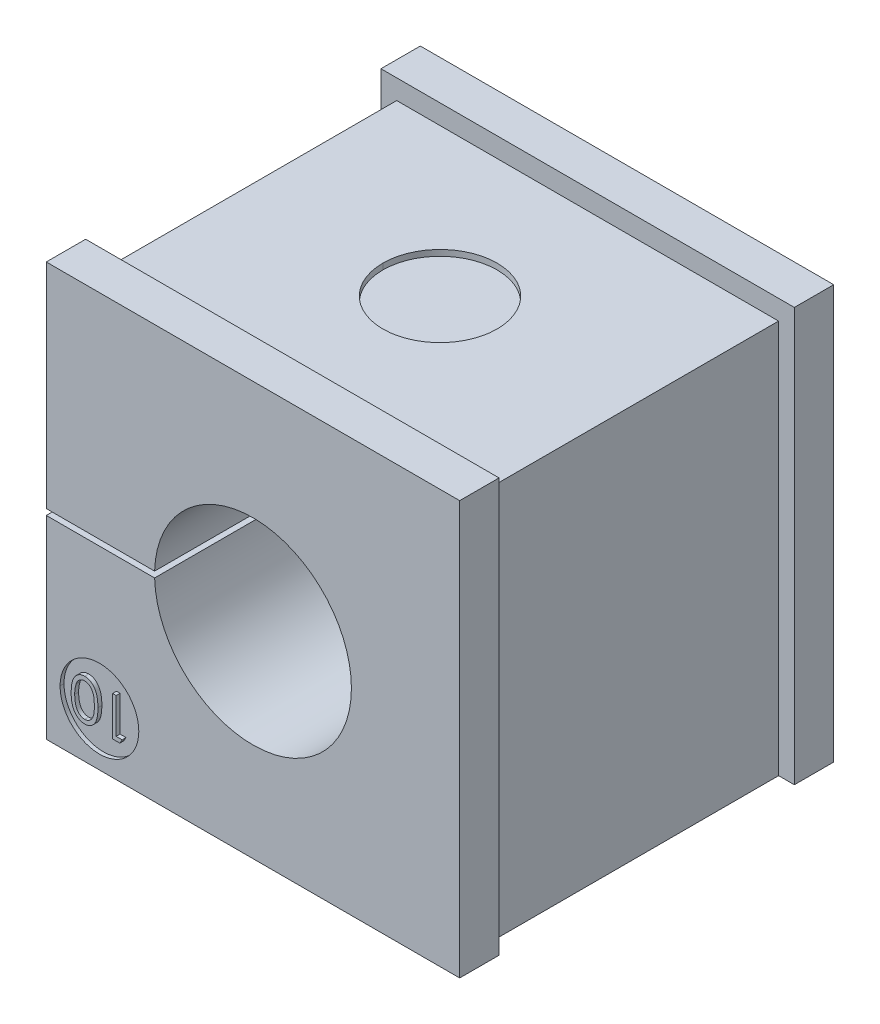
ISO-10303-21;
HEADER;
FILE_DESCRIPTION(('STEP AP214'),'2;1');
FILE_NAME('part.step','',(''),(''),'','','');
FILE_SCHEMA(('AUTOMOTIVE_DESIGN { 1 0 10303 214 1 1 1 1 }'));
ENDSEC;
DATA;
#1=APPLICATION_CONTEXT('core data for automotive mechanical design processes');
#2=APPLICATION_PROTOCOL_DEFINITION('international standard','automotive_design',2000,#1);
#3=PRODUCT_CONTEXT('',#1,'mechanical');
#4=PRODUCT('Part','Part','',(#3));
#5=PRODUCT_RELATED_PRODUCT_CATEGORY('part','',(#4));
#6=PRODUCT_DEFINITION_FORMATION('','',#4);
#7=PRODUCT_DEFINITION_CONTEXT('part definition',#1,'design');
#8=PRODUCT_DEFINITION('design','',#6,#7);
#9=PRODUCT_DEFINITION_SHAPE('','',#8);
#10=(LENGTH_UNIT() NAMED_UNIT(*) SI_UNIT(.MILLI.,.METRE.));
#11=(NAMED_UNIT(*) PLANE_ANGLE_UNIT() SI_UNIT($,.RADIAN.));
#12=(NAMED_UNIT(*) SI_UNIT($,.STERADIAN.) SOLID_ANGLE_UNIT());
#13=UNCERTAINTY_MEASURE_WITH_UNIT(LENGTH_MEASURE(1.E-05),#10,'distance_accuracy_value','');
#14=(GEOMETRIC_REPRESENTATION_CONTEXT(3) GLOBAL_UNCERTAINTY_ASSIGNED_CONTEXT((#13)) GLOBAL_UNIT_ASSIGNED_CONTEXT((#10,
#11,#12)) REPRESENTATION_CONTEXT('',''));
#15=CARTESIAN_POINT('',(0.,0.,0.));
#16=DIRECTION('',(0.,0.,1.));
#17=DIRECTION('',(1.,0.,0.));
#18=AXIS2_PLACEMENT_3D('',#15,#16,#17);
#19=CARTESIAN_POINT('',(2.7,-7.8,9.3));
#20=DIRECTION('',(0.,0.,1.));
#21=DIRECTION('',(1.,0.,0.));
#22=AXIS2_PLACEMENT_3D('',#19,#20,#21);
#23=PLANE('',#22);
#24=CARTESIAN_POINT('',(1.94839743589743,-8.64615384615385,9.3));
#25=CARTESIAN_POINT('',(1.97052206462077,-8.64500298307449,9.3));
#26=CARTESIAN_POINT('',(2.01481162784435,-8.64269916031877,9.3));
#27=CARTESIAN_POINT('',(2.08009276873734,-8.62616542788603,9.3));
#28=CARTESIAN_POINT('',(2.14288963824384,-8.59826438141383,9.3));
#29=CARTESIAN_POINT('',(2.19260675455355,-8.56670237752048,9.3));
#30=CARTESIAN_POINT('',(2.23043468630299,-8.53637890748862,9.3));
#31=CARTESIAN_POINT('',(2.25735371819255,-8.51049846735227,9.3));
#32=CARTESIAN_POINT('',(2.28275825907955,-8.48232609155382,9.3));
#33=CARTESIAN_POINT('',(2.30646398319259,-8.45146053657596,9.3));
#34=CARTESIAN_POINT('',(2.32788803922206,-8.41780363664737,9.3));
#35=CARTESIAN_POINT('',(2.34772640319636,-8.38181849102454,9.3));
#36=CARTESIAN_POINT('',(2.36567643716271,-8.34323203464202,9.3));
#37=CARTESIAN_POINT('',(2.38233810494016,-8.30174513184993,9.3));
#38=CARTESIAN_POINT('',(2.39675632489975,-8.25619161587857,9.3));
#39=CARTESIAN_POINT('',(2.40971998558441,-8.20610889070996,9.3));
#40=CARTESIAN_POINT('',(2.41972598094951,-8.15060616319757,9.3));
#41=CARTESIAN_POINT('',(2.42861042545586,-8.09023045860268,9.3));
#42=CARTESIAN_POINT('',(2.43532605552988,-8.02486011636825,9.3));
#43=CARTESIAN_POINT('',(2.43991706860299,-7.95443005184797,9.3));
#44=CARTESIAN_POINT('',(2.44339504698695,-7.87896055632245,9.3));
#45=CARTESIAN_POINT('',(2.44352354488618,-7.82684734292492,9.3));
#46=CARTESIAN_POINT('',(2.44358974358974,-7.8,9.3));
#47=(BOUNDED_CURVE() B_SPLINE_CURVE(3,(#24,#25,#26,#27,#28,#29,#30,#31,#32,#33,#34,#35,#36,#37,
#38,#39,#40,#41,#42,#43,#44,#45,#46),.UNSPECIFIED.,.F.,.F.) B_SPLINE_CURVE_WITH_KNOTS((4,1,1,1,
1,1,1,1,1,1,1,1,1,1,1,1,1,1,1,1,4),(0.,0.0603889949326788,0.120888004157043,0.182614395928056,
0.247364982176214,0.28108194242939,0.314871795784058,0.349216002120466,0.384592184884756,
0.421009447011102,0.458060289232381,0.496725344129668,0.537154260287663,0.580056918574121,
0.627112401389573,0.678324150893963,0.733972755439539,0.793738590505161,0.857708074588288,
0.926694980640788,1.),
.UNSPECIFIED.) CURVE() GEOMETRIC_REPRESENTATION_ITEM() RATIONAL_B_SPLINE_CURVE((1.,1.,1.,1.,1.,
1.,1.,1.,1.,1.,1.,1.,1.,1.,1.,1.,1.,1.,1.,1.,1.,1.,1.)) REPRESENTATION_ITEM(''));
#48=CARTESIAN_POINT('',(1.94839743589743,-8.64615384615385,9.3));
#49=VERTEX_POINT('',#48);
#50=CARTESIAN_POINT('',(2.44358974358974,-7.8,9.3));
#51=VERTEX_POINT('',#50);
#52=EDGE_CURVE('E124',#49,#51,#47,.T.);
#53=ORIENTED_EDGE('',*,*,#52,.T.);
#54=CARTESIAN_POINT('',(2.44358974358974,-7.8,9.3));
#55=CARTESIAN_POINT('',(2.44351999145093,-7.77328656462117,9.3));
#56=CARTESIAN_POINT('',(2.44338461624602,-7.72144103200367,9.3));
#57=CARTESIAN_POINT('',(2.43995038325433,-7.64623370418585,9.3));
#58=CARTESIAN_POINT('',(2.43517028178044,-7.57596997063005,9.3));
#59=CARTESIAN_POINT('',(2.42915663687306,-7.51067725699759,9.3));
#60=CARTESIAN_POINT('',(2.42015035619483,-7.45058375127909,9.3));
#61=CARTESIAN_POINT('',(2.40993215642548,-7.39543964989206,9.3));
#62=CARTESIAN_POINT('',(2.39767612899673,-7.34534693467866,9.3));
#63=CARTESIAN_POINT('',(2.38310328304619,-7.29986814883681,9.3));
#64=CARTESIAN_POINT('',(2.36650426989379,-7.25835830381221,9.3));
#65=CARTESIAN_POINT('',(2.34840987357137,-7.21971444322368,9.3));
#66=CARTESIAN_POINT('',(2.32880973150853,-7.18346652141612,9.3));
#67=CARTESIAN_POINT('',(2.30725415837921,-7.14974532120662,9.3));
#68=CARTESIAN_POINT('',(2.2834343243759,-7.11873918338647,9.3));
#69=CARTESIAN_POINT('',(2.25788189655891,-7.0903008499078,9.3));
#70=CARTESIAN_POINT('',(2.23044829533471,-7.06454611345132,9.3));
#71=CARTESIAN_POINT('',(2.19248024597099,-7.03398045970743,9.3));
#72=CARTESIAN_POINT('',(2.14259918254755,-7.00202296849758,9.3));
#73=CARTESIAN_POINT('',(2.07942980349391,-6.97453648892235,9.3));
#74=CARTESIAN_POINT('',(2.01449180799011,-6.95715133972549,9.3));
#75=CARTESIAN_POINT('',(1.97040335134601,-6.95494660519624,9.3));
#76=CARTESIAN_POINT('',(1.94839743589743,-6.95384615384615,9.3));
#77=(BOUNDED_CURVE() B_SPLINE_CURVE(3,(#54,#55,#56,#57,#58,#59,#60,#61,#62,#63,#64,#65,#66,#67,
#68,#69,#70,#71,#72,#73,#74,#75,#76),.UNSPECIFIED.,.F.,.F.) B_SPLINE_CURVE_WITH_KNOTS((4,1,1,1,
1,1,1,1,1,1,1,1,1,1,1,1,1,1,1,1,4),(0.,0.0729596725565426,0.141600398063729,0.205586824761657,
0.265331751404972,0.320634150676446,0.37150103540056,0.418479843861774,0.461393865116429,
0.501833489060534,0.54050878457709,0.577889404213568,0.614316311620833,0.649701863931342,
0.684570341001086,0.718633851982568,0.752359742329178,0.817630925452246,0.879707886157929,
0.93995847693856,1.),
.UNSPECIFIED.) CURVE() GEOMETRIC_REPRESENTATION_ITEM() RATIONAL_B_SPLINE_CURVE((1.,1.,1.,1.,1.,
1.,1.,1.,1.,1.,1.,1.,1.,1.,1.,1.,1.,1.,1.,1.,1.,1.,1.)) REPRESENTATION_ITEM(''));
#78=CARTESIAN_POINT('',(1.94839743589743,-6.95384615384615,9.3));
#79=VERTEX_POINT('',#78);
#80=EDGE_CURVE('E109',#51,#79,#77,.T.);
#81=ORIENTED_EDGE('',*,*,#80,.T.);
#82=CARTESIAN_POINT('',(1.94839743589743,-6.95384615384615,9.3));
#83=CARTESIAN_POINT('',(1.9262651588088,-6.95481109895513,9.3));
#84=CARTESIAN_POINT('',(1.88207911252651,-6.9567375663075,9.3));
#85=CARTESIAN_POINT('',(1.81718531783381,-6.97355101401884,9.3));
#86=CARTESIAN_POINT('',(1.75470732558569,-7.0008843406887,9.3));
#87=CARTESIAN_POINT('',(1.70540035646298,-7.03211201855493,9.3));
#88=CARTESIAN_POINT('',(1.66799258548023,-7.06204155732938,9.3));
#89=CARTESIAN_POINT('',(1.64118064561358,-7.08752994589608,9.3));
#90=CARTESIAN_POINT('',(1.61657438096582,-7.11607773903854,9.3));
#91=CARTESIAN_POINT('',(1.59323588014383,-7.14687689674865,9.3));
#92=CARTESIAN_POINT('',(1.57183074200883,-7.18051843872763,9.3));
#93=CARTESIAN_POINT('',(1.55236607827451,-7.21683987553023,9.3));
#94=CARTESIAN_POINT('',(1.53460416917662,-7.25594227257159,9.3));
#95=CARTESIAN_POINT('',(1.52448471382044,-7.28323926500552,9.3));
#96=CARTESIAN_POINT('',(1.5193108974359,-7.29719551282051,9.3));
#97=(BOUNDED_CURVE() B_SPLINE_CURVE(3,(#82,#83,#84,#85,#86,#87,#88,#89,#90,#91,#92,#93,#94,#95,
#96),.UNSPECIFIED.,.F.,.F.) B_SPLINE_CURVE_WITH_KNOTS((4,1,1,1,1,1,1,1,1,1,1,1,4),(0.,
0.112801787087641,0.225203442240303,0.339662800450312,0.459731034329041,0.521784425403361,
0.583968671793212,0.648210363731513,0.713910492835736,0.781026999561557,0.851466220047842,
0.92405851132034,1.),
.UNSPECIFIED.) CURVE() GEOMETRIC_REPRESENTATION_ITEM() RATIONAL_B_SPLINE_CURVE((1.,1.,1.,1.,1.,
1.,1.,1.,1.,1.,1.,1.,1.,1.,1.)) REPRESENTATION_ITEM(''));
#98=CARTESIAN_POINT('',(1.5193108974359,-7.29719551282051,9.3));
#99=VERTEX_POINT('',#98);
#100=EDGE_CURVE('E151',#79,#99,#97,.T.);
#101=ORIENTED_EDGE('',*,*,#100,.T.);
#102=CARTESIAN_POINT('',(1.5193108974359,-7.29719551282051,9.3));
#103=CARTESIAN_POINT('',(1.51328131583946,-7.31504107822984,9.3));
#104=CARTESIAN_POINT('',(1.50103867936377,-7.35127522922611,9.3));
#105=CARTESIAN_POINT('',(1.48526052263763,-7.40748303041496,9.3));
#106=CARTESIAN_POINT('',(1.47283458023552,-7.46645603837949,9.3));
#107=CARTESIAN_POINT('',(1.46165551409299,-7.52784181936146,9.3));
#108=CARTESIAN_POINT('',(1.45402519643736,-7.59209307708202,9.3));
#109=CARTESIAN_POINT('',(1.44788358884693,-7.65901101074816,9.3));
#110=CARTESIAN_POINT('',(1.44426605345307,-7.7286460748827,9.3));
#111=CARTESIAN_POINT('',(1.44381762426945,-7.77595749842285,9.3));
#112=CARTESIAN_POINT('',(1.44358974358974,-7.8,9.3));
#113=(BOUNDED_CURVE() B_SPLINE_CURVE(3,(#102,#103,#104,#105,#106,#107,#108,#109,#110,#111,#112),
.UNSPECIFIED.,.F.,.F.) B_SPLINE_CURVE_WITH_KNOTS((4,1,1,1,1,1,1,1,4),(0.,0.110588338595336,
0.224541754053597,0.342503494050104,0.464324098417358,0.590756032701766,0.722227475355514,
0.858842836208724,1.),
.UNSPECIFIED.) CURVE() GEOMETRIC_REPRESENTATION_ITEM() RATIONAL_B_SPLINE_CURVE((1.,1.,1.,1.,1.,
1.,1.,1.,1.,1.,1.)) REPRESENTATION_ITEM(''));
#114=CARTESIAN_POINT('',(1.44358974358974,-7.8,9.3));
#115=VERTEX_POINT('',#114);
#116=EDGE_CURVE('E18',#99,#115,#113,.T.);
#117=ORIENTED_EDGE('',*,*,#116,.T.);
#118=CARTESIAN_POINT('',(1.44358974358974,-7.8,9.3));
#119=CARTESIAN_POINT('',(1.44384107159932,-7.82404198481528,9.3));
#120=CARTESIAN_POINT('',(1.44433278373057,-7.87107906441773,9.3));
#121=CARTESIAN_POINT('',(1.44756337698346,-7.93989435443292,9.3));
#122=CARTESIAN_POINT('',(1.45275467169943,-8.00536826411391,9.3));
#123=CARTESIAN_POINT('',(1.45978097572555,-8.06756018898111,9.3));
#124=CARTESIAN_POINT('',(1.46942660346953,-8.12635943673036,9.3));
#125=CARTESIAN_POINT('',(1.48101004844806,-8.18185014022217,9.3));
#126=CARTESIAN_POINT('',(1.49459028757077,-8.23401736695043,9.3));
#127=CARTESIAN_POINT('',(1.51016729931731,-8.28299555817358,9.3));
#128=CARTESIAN_POINT('',(1.52772212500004,-8.32860899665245,9.3));
#129=CARTESIAN_POINT('',(1.54711580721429,-8.37095587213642,9.3));
#130=CARTESIAN_POINT('',(1.56780850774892,-8.410264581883,9.3));
#131=CARTESIAN_POINT('',(1.59029857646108,-8.4464086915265,9.3));
#132=CARTESIAN_POINT('',(1.61426781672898,-8.47959910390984,9.3));
#133=CARTESIAN_POINT('',(1.6405768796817,-8.50907179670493,9.3));
#134=CARTESIAN_POINT('',(1.66755463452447,-8.53626053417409,9.3));
#135=CARTESIAN_POINT('',(1.70592271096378,-8.56674111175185,9.3));
#136=CARTESIAN_POINT('',(1.75574481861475,-8.59806493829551,9.3));
#137=CARTESIAN_POINT('',(1.81816799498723,-8.62610687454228,9.3));
#138=CARTESIAN_POINT('',(1.88277329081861,-8.64270284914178,9.3));
#139=CARTESIAN_POINT('',(1.92653849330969,-8.64500434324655,9.3));
#140=CARTESIAN_POINT('',(1.94839743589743,-8.64615384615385,9.3));
#141=(BOUNDED_CURVE() B_SPLINE_CURVE(3,(#118,#119,#120,#121,#122,#123,#124,#125,#126,#127,#128,
#129,#130,#131,#132,#133,#134,#135,#136,#137,#138,#139,#140),.UNSPECIFIED.,.F.,
.F.) B_SPLINE_CURVE_WITH_KNOTS((4,1,1,1,1,1,1,1,1,1,1,1,1,1,1,1,1,1,1,1,4),(0.,
0.0656764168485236,0.128493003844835,0.188147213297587,0.245074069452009,0.299412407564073,
0.350856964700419,0.399878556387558,0.446605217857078,0.491184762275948,0.533303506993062,
0.57377697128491,0.61244771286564,0.649515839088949,0.685448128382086,0.720274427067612,
0.754003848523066,0.819086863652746,0.880502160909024,0.940315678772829,1.),
.UNSPECIFIED.) CURVE() GEOMETRIC_REPRESENTATION_ITEM() RATIONAL_B_SPLINE_CURVE((1.,1.,1.,1.,1.,
1.,1.,1.,1.,1.,1.,1.,1.,1.,1.,1.,1.,1.,1.,1.,1.,1.,1.)) REPRESENTATION_ITEM(''));
#142=EDGE_CURVE('E9',#115,#49,#141,.T.);
#143=ORIENTED_EDGE('',*,*,#142,.T.);
#144=EDGE_LOOP('',(#53,#81,#101,#117,#143));
#145=FACE_BOUND('',#144,.T.);
#146=ADVANCED_FACE('F15',(#145),#23,.T.);
#147=CARTESIAN_POINT('',(1.44358974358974,-7.8,9.5));
#148=CARTESIAN_POINT('',(1.44358974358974,-7.8,9.3));
#149=CARTESIAN_POINT('',(1.44384107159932,-7.82404198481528,9.5));
#150=CARTESIAN_POINT('',(1.44384107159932,-7.82404198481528,9.3));
#151=CARTESIAN_POINT('',(1.44433278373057,-7.87107906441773,9.5));
#152=CARTESIAN_POINT('',(1.44433278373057,-7.87107906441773,9.3));
#153=CARTESIAN_POINT('',(1.44756337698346,-7.93989435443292,9.5));
#154=CARTESIAN_POINT('',(1.44756337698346,-7.93989435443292,9.3));
#155=CARTESIAN_POINT('',(1.45275467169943,-8.00536826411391,9.5));
#156=CARTESIAN_POINT('',(1.45275467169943,-8.00536826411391,9.3));
#157=CARTESIAN_POINT('',(1.45978097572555,-8.06756018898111,9.5));
#158=CARTESIAN_POINT('',(1.45978097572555,-8.06756018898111,9.3));
#159=CARTESIAN_POINT('',(1.46942660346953,-8.12635943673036,9.5));
#160=CARTESIAN_POINT('',(1.46942660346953,-8.12635943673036,9.3));
#161=CARTESIAN_POINT('',(1.48101004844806,-8.18185014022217,9.5));
#162=CARTESIAN_POINT('',(1.48101004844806,-8.18185014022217,9.3));
#163=CARTESIAN_POINT('',(1.49459028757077,-8.23401736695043,9.5));
#164=CARTESIAN_POINT('',(1.49459028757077,-8.23401736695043,9.3));
#165=CARTESIAN_POINT('',(1.51016729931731,-8.28299555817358,9.5));
#166=CARTESIAN_POINT('',(1.51016729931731,-8.28299555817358,9.3));
#167=CARTESIAN_POINT('',(1.52772212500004,-8.32860899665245,9.5));
#168=CARTESIAN_POINT('',(1.52772212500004,-8.32860899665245,9.3));
#169=CARTESIAN_POINT('',(1.54711580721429,-8.37095587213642,9.5));
#170=CARTESIAN_POINT('',(1.54711580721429,-8.37095587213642,9.3));
#171=CARTESIAN_POINT('',(1.56780850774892,-8.410264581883,9.5));
#172=CARTESIAN_POINT('',(1.56780850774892,-8.410264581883,9.3));
#173=CARTESIAN_POINT('',(1.59029857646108,-8.4464086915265,9.5));
#174=CARTESIAN_POINT('',(1.59029857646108,-8.4464086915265,9.3));
#175=CARTESIAN_POINT('',(1.61426781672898,-8.47959910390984,9.5));
#176=CARTESIAN_POINT('',(1.61426781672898,-8.47959910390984,9.3));
#177=CARTESIAN_POINT('',(1.6405768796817,-8.50907179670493,9.5));
#178=CARTESIAN_POINT('',(1.6405768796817,-8.50907179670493,9.3));
#179=CARTESIAN_POINT('',(1.66755463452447,-8.53626053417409,9.5));
#180=CARTESIAN_POINT('',(1.66755463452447,-8.53626053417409,9.3));
#181=CARTESIAN_POINT('',(1.70592271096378,-8.56674111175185,9.5));
#182=CARTESIAN_POINT('',(1.70592271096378,-8.56674111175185,9.3));
#183=CARTESIAN_POINT('',(1.75574481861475,-8.59806493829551,9.5));
#184=CARTESIAN_POINT('',(1.75574481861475,-8.59806493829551,9.3));
#185=CARTESIAN_POINT('',(1.81816799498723,-8.62610687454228,9.5));
#186=CARTESIAN_POINT('',(1.81816799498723,-8.62610687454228,9.3));
#187=CARTESIAN_POINT('',(1.88277329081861,-8.64270284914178,9.5));
#188=CARTESIAN_POINT('',(1.88277329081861,-8.64270284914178,9.3));
#189=CARTESIAN_POINT('',(1.92653849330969,-8.64500434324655,9.5));
#190=CARTESIAN_POINT('',(1.92653849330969,-8.64500434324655,9.3));
#191=CARTESIAN_POINT('',(1.94839743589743,-8.64615384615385,9.5));
#192=CARTESIAN_POINT('',(1.94839743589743,-8.64615384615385,9.3));
#193=(BOUNDED_SURFACE() B_SPLINE_SURFACE(3,1,((#147,#148),(#149,#150),(#151,#152),(#153,#154),
(#155,#156),(#157,#158),(#159,#160),(#161,#162),(#163,#164),(#165,#166),(#167,#168),(#169,#170),
(#171,#172),(#173,#174),(#175,#176),(#177,#178),(#179,#180),(#181,#182),(#183,#184),(#185,#186),
(#187,#188),(#189,#190),(#191,#192)),.UNSPECIFIED.,.F.,.F.,.F.) B_SPLINE_SURFACE_WITH_KNOTS((4,
1,1,1,1,1,1,1,1,1,1,1,1,1,1,1,1,1,1,1,4),(2,2),(0.,0.0656764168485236,0.128493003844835,
0.188147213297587,0.245074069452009,0.299412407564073,0.350856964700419,0.399878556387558,
0.446605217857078,0.491184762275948,0.533303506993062,0.57377697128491,0.61244771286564,
0.649515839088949,0.685448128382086,0.720274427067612,0.754003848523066,0.819086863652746,
0.880502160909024,0.940315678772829,1.),(0.,1.),
.UNSPECIFIED.) GEOMETRIC_REPRESENTATION_ITEM() RATIONAL_B_SPLINE_SURFACE(((1.,1.),(1.,1.),(1.,
1.),(1.,1.),(1.,1.),(1.,1.),(1.,1.),(1.,1.),(1.,1.),(1.,1.),(1.,1.),(1.,1.),(1.,1.),(1.,1.),(1.,
1.),(1.,1.),(1.,1.),(1.,1.),(1.,1.),(1.,1.),(1.,1.),(1.,1.),(1.,1.))) REPRESENTATION_ITEM('') SURFACE());
#194=DIRECTION('',(0.,0.,-1.));
#195=VECTOR('',#194,1.);
#196=CARTESIAN_POINT('',(1.44358974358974,-7.8,9.5));
#197=LINE('',#196,#195);
#198=CARTESIAN_POINT('',(1.44358974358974,-7.8,9.5));
#199=VERTEX_POINT('',#198);
#200=EDGE_CURVE('E26',#199,#115,#197,.T.);
#201=CARTESIAN_POINT('',(1.44358974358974,-7.8,9.5));
#202=CARTESIAN_POINT('',(1.44384107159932,-7.82404198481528,9.5));
#203=CARTESIAN_POINT('',(1.44433278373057,-7.87107906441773,9.5));
#204=CARTESIAN_POINT('',(1.44756337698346,-7.93989435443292,9.5));
#205=CARTESIAN_POINT('',(1.45275467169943,-8.00536826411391,9.5));
#206=CARTESIAN_POINT('',(1.45978097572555,-8.06756018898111,9.5));
#207=CARTESIAN_POINT('',(1.46942660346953,-8.12635943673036,9.5));
#208=CARTESIAN_POINT('',(1.48101004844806,-8.18185014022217,9.5));
#209=CARTESIAN_POINT('',(1.49459028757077,-8.23401736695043,9.5));
#210=CARTESIAN_POINT('',(1.51016729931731,-8.28299555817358,9.5));
#211=CARTESIAN_POINT('',(1.52772212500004,-8.32860899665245,9.5));
#212=CARTESIAN_POINT('',(1.54711580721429,-8.37095587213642,9.5));
#213=CARTESIAN_POINT('',(1.56780850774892,-8.410264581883,9.5));
#214=CARTESIAN_POINT('',(1.59029857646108,-8.4464086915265,9.5));
#215=CARTESIAN_POINT('',(1.61426781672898,-8.47959910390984,9.5));
#216=CARTESIAN_POINT('',(1.6405768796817,-8.50907179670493,9.5));
#217=CARTESIAN_POINT('',(1.66755463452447,-8.53626053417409,9.5));
#218=CARTESIAN_POINT('',(1.70592271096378,-8.56674111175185,9.5));
#219=CARTESIAN_POINT('',(1.75574481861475,-8.59806493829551,9.5));
#220=CARTESIAN_POINT('',(1.81816799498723,-8.62610687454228,9.5));
#221=CARTESIAN_POINT('',(1.88277329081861,-8.64270284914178,9.5));
#222=CARTESIAN_POINT('',(1.92653849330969,-8.64500434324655,9.5));
#223=CARTESIAN_POINT('',(1.94839743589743,-8.64615384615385,9.5));
#224=(BOUNDED_CURVE() B_SPLINE_CURVE(3,(#201,#202,#203,#204,#205,#206,#207,#208,#209,#210,#211,
#212,#213,#214,#215,#216,#217,#218,#219,#220,#221,#222,#223),.UNSPECIFIED.,.F.,
.F.) B_SPLINE_CURVE_WITH_KNOTS((4,1,1,1,1,1,1,1,1,1,1,1,1,1,1,1,1,1,1,1,4),(0.,
0.0656764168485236,0.128493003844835,0.188147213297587,0.245074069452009,0.299412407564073,
0.350856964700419,0.399878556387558,0.446605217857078,0.491184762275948,0.533303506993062,
0.57377697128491,0.61244771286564,0.649515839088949,0.685448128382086,0.720274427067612,
0.754003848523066,0.819086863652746,0.880502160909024,0.940315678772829,1.),
.UNSPECIFIED.) CURVE() GEOMETRIC_REPRESENTATION_ITEM() RATIONAL_B_SPLINE_CURVE((1.,1.,1.,1.,1.,
1.,1.,1.,1.,1.,1.,1.,1.,1.,1.,1.,1.,1.,1.,1.,1.,1.,1.)) REPRESENTATION_ITEM(''));
#225=CARTESIAN_POINT('',(1.94839743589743,-8.64615384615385,9.5));
#226=VERTEX_POINT('',#225);
#227=EDGE_CURVE('E208',#199,#226,#224,.T.);
#228=DIRECTION('',(0.,0.,-1.));
#229=VECTOR('',#228,1.);
#230=CARTESIAN_POINT('',(1.94839743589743,-8.64615384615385,9.5));
#231=LINE('',#230,#229);
#232=EDGE_CURVE('E129',#226,#49,#231,.T.);
#233=ORIENTED_EDGE('',*,*,#142,.F.);
#234=ORIENTED_EDGE('',*,*,#200,.F.);
#235=ORIENTED_EDGE('',*,*,#227,.T.);
#236=ORIENTED_EDGE('',*,*,#232,.T.);
#237=EDGE_LOOP('',(#233,#234,#235,#236));
#238=FACE_BOUND('',#237,.T.);
#239=ADVANCED_FACE('F1243',(#238),#193,.T.);
#240=CARTESIAN_POINT('',(1.5193108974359,-7.29719551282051,9.5));
#241=CARTESIAN_POINT('',(1.5193108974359,-7.29719551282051,9.3));
#242=CARTESIAN_POINT('',(1.51328131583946,-7.31504107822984,9.5));
#243=CARTESIAN_POINT('',(1.51328131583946,-7.31504107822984,9.3));
#244=CARTESIAN_POINT('',(1.50103867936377,-7.35127522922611,9.5));
#245=CARTESIAN_POINT('',(1.50103867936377,-7.35127522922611,9.3));
#246=CARTESIAN_POINT('',(1.48526052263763,-7.40748303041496,9.5));
#247=CARTESIAN_POINT('',(1.48526052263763,-7.40748303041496,9.3));
#248=CARTESIAN_POINT('',(1.47283458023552,-7.46645603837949,9.5));
#249=CARTESIAN_POINT('',(1.47283458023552,-7.46645603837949,9.3));
#250=CARTESIAN_POINT('',(1.46165551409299,-7.52784181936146,9.5));
#251=CARTESIAN_POINT('',(1.46165551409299,-7.52784181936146,9.3));
#252=CARTESIAN_POINT('',(1.45402519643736,-7.59209307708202,9.5));
#253=CARTESIAN_POINT('',(1.45402519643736,-7.59209307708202,9.3));
#254=CARTESIAN_POINT('',(1.44788358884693,-7.65901101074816,9.5));
#255=CARTESIAN_POINT('',(1.44788358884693,-7.65901101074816,9.3));
#256=CARTESIAN_POINT('',(1.44426605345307,-7.7286460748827,9.5));
#257=CARTESIAN_POINT('',(1.44426605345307,-7.7286460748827,9.3));
#258=CARTESIAN_POINT('',(1.44381762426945,-7.77595749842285,9.5));
#259=CARTESIAN_POINT('',(1.44381762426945,-7.77595749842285,9.3));
#260=CARTESIAN_POINT('',(1.44358974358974,-7.8,9.5));
#261=CARTESIAN_POINT('',(1.44358974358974,-7.8,9.3));
#262=(BOUNDED_SURFACE() B_SPLINE_SURFACE(3,1,((#240,#241),(#242,#243),(#244,#245),(#246,#247),
(#248,#249),(#250,#251),(#252,#253),(#254,#255),(#256,#257),(#258,#259),(#260,#261)),
.UNSPECIFIED.,.F.,.F.,.F.) B_SPLINE_SURFACE_WITH_KNOTS((4,1,1,1,1,1,1,1,4),(2,2),(0.,
0.110588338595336,0.224541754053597,0.342503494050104,0.464324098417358,0.590756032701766,
0.722227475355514,0.858842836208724,1.),(0.,1.),
.UNSPECIFIED.) GEOMETRIC_REPRESENTATION_ITEM() RATIONAL_B_SPLINE_SURFACE(((1.,1.),(1.,1.),(1.,
1.),(1.,1.),(1.,1.),(1.,1.),(1.,1.),(1.,1.),(1.,1.),(1.,1.),(1.,1.))) REPRESENTATION_ITEM('') SURFACE());
#263=DIRECTION('',(0.,0.,-1.));
#264=VECTOR('',#263,1.);
#265=CARTESIAN_POINT('',(1.5193108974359,-7.29719551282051,9.5));
#266=LINE('',#265,#264);
#267=CARTESIAN_POINT('',(1.5193108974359,-7.29719551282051,9.5));
#268=VERTEX_POINT('',#267);
#269=EDGE_CURVE('E155',#268,#99,#266,.T.);
#270=CARTESIAN_POINT('',(1.5193108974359,-7.29719551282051,9.5));
#271=CARTESIAN_POINT('',(1.51328131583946,-7.31504107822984,9.5));
#272=CARTESIAN_POINT('',(1.50103867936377,-7.35127522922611,9.5));
#273=CARTESIAN_POINT('',(1.48526052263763,-7.40748303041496,9.5));
#274=CARTESIAN_POINT('',(1.47283458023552,-7.46645603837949,9.5));
#275=CARTESIAN_POINT('',(1.46165551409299,-7.52784181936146,9.5));
#276=CARTESIAN_POINT('',(1.45402519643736,-7.59209307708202,9.5));
#277=CARTESIAN_POINT('',(1.44788358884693,-7.65901101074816,9.5));
#278=CARTESIAN_POINT('',(1.44426605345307,-7.7286460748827,9.5));
#279=CARTESIAN_POINT('',(1.44381762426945,-7.77595749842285,9.5));
#280=CARTESIAN_POINT('',(1.44358974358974,-7.8,9.5));
#281=(BOUNDED_CURVE() B_SPLINE_CURVE(3,(#270,#271,#272,#273,#274,#275,#276,#277,#278,#279,#280),
.UNSPECIFIED.,.F.,.F.) B_SPLINE_CURVE_WITH_KNOTS((4,1,1,1,1,1,1,1,4),(0.,0.110588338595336,
0.224541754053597,0.342503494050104,0.464324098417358,0.590756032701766,0.722227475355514,
0.858842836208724,1.),
.UNSPECIFIED.) CURVE() GEOMETRIC_REPRESENTATION_ITEM() RATIONAL_B_SPLINE_CURVE((1.,1.,1.,1.,1.,
1.,1.,1.,1.,1.,1.)) REPRESENTATION_ITEM(''));
#282=EDGE_CURVE('E219',#268,#199,#281,.T.);
#283=ORIENTED_EDGE('',*,*,#116,.F.);
#284=ORIENTED_EDGE('',*,*,#269,.F.);
#285=ORIENTED_EDGE('',*,*,#282,.T.);
#286=ORIENTED_EDGE('',*,*,#200,.T.);
#287=EDGE_LOOP('',(#283,#284,#285,#286));
#288=FACE_BOUND('',#287,.T.);
#289=ADVANCED_FACE('F1082',(#288),#262,.T.);
#290=CARTESIAN_POINT('',(1.94839743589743,-6.95384615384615,9.5));
#291=CARTESIAN_POINT('',(1.94839743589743,-6.95384615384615,9.3));
#292=CARTESIAN_POINT('',(1.9262651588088,-6.95481109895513,9.5));
#293=CARTESIAN_POINT('',(1.9262651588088,-6.95481109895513,9.3));
#294=CARTESIAN_POINT('',(1.88207911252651,-6.9567375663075,9.5));
#295=CARTESIAN_POINT('',(1.88207911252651,-6.9567375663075,9.3));
#296=CARTESIAN_POINT('',(1.81718531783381,-6.97355101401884,9.5));
#297=CARTESIAN_POINT('',(1.81718531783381,-6.97355101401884,9.3));
#298=CARTESIAN_POINT('',(1.75470732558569,-7.0008843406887,9.5));
#299=CARTESIAN_POINT('',(1.75470732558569,-7.0008843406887,9.3));
#300=CARTESIAN_POINT('',(1.70540035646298,-7.03211201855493,9.5));
#301=CARTESIAN_POINT('',(1.70540035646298,-7.03211201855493,9.3));
#302=CARTESIAN_POINT('',(1.66799258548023,-7.06204155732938,9.5));
#303=CARTESIAN_POINT('',(1.66799258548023,-7.06204155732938,9.3));
#304=CARTESIAN_POINT('',(1.64118064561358,-7.08752994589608,9.5));
#305=CARTESIAN_POINT('',(1.64118064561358,-7.08752994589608,9.3));
#306=CARTESIAN_POINT('',(1.61657438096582,-7.11607773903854,9.5));
#307=CARTESIAN_POINT('',(1.61657438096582,-7.11607773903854,9.3));
#308=CARTESIAN_POINT('',(1.59323588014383,-7.14687689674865,9.5));
#309=CARTESIAN_POINT('',(1.59323588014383,-7.14687689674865,9.3));
#310=CARTESIAN_POINT('',(1.57183074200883,-7.18051843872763,9.5));
#311=CARTESIAN_POINT('',(1.57183074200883,-7.18051843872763,9.3));
#312=CARTESIAN_POINT('',(1.55236607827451,-7.21683987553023,9.5));
#313=CARTESIAN_POINT('',(1.55236607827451,-7.21683987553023,9.3));
#314=CARTESIAN_POINT('',(1.53460416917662,-7.25594227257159,9.5));
#315=CARTESIAN_POINT('',(1.53460416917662,-7.25594227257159,9.3));
#316=CARTESIAN_POINT('',(1.52448471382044,-7.28323926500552,9.5));
#317=CARTESIAN_POINT('',(1.52448471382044,-7.28323926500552,9.3));
#318=CARTESIAN_POINT('',(1.5193108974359,-7.29719551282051,9.5));
#319=CARTESIAN_POINT('',(1.5193108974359,-7.29719551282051,9.3));
#320=(BOUNDED_SURFACE() B_SPLINE_SURFACE(3,1,((#290,#291),(#292,#293),(#294,#295),(#296,#297),
(#298,#299),(#300,#301),(#302,#303),(#304,#305),(#306,#307),(#308,#309),(#310,#311),(#312,#313),
(#314,#315),(#316,#317),(#318,#319)),.UNSPECIFIED.,.F.,.F.,.F.) B_SPLINE_SURFACE_WITH_KNOTS((4,
1,1,1,1,1,1,1,1,1,1,1,4),(2,2),(0.,0.112801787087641,0.225203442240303,0.339662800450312,
0.459731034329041,0.521784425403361,0.583968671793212,0.648210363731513,0.713910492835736,
0.781026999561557,0.851466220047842,0.92405851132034,1.),(0.,1.),
.UNSPECIFIED.) GEOMETRIC_REPRESENTATION_ITEM() RATIONAL_B_SPLINE_SURFACE(((1.,1.),(1.,1.),(1.,
1.),(1.,1.),(1.,1.),(1.,1.),(1.,1.),(1.,1.),(1.,1.),(1.,1.),(1.,1.),(1.,1.),(1.,1.),(1.,1.),(1.,1.))) REPRESENTATION_ITEM('') SURFACE());
#321=DIRECTION('',(0.,0.,-1.));
#322=VECTOR('',#321,1.);
#323=CARTESIAN_POINT('',(1.94839743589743,-6.95384615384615,9.5));
#324=LINE('',#323,#322);
#325=CARTESIAN_POINT('',(1.94839743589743,-6.95384615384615,9.5));
#326=VERTEX_POINT('',#325);
#327=EDGE_CURVE('E115',#326,#79,#324,.T.);
#328=CARTESIAN_POINT('',(1.94839743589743,-6.95384615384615,9.5));
#329=CARTESIAN_POINT('',(1.9262651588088,-6.95481109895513,9.5));
#330=CARTESIAN_POINT('',(1.88207911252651,-6.9567375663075,9.5));
#331=CARTESIAN_POINT('',(1.81718531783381,-6.97355101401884,9.5));
#332=CARTESIAN_POINT('',(1.75470732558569,-7.0008843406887,9.5));
#333=CARTESIAN_POINT('',(1.70540035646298,-7.03211201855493,9.5));
#334=CARTESIAN_POINT('',(1.66799258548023,-7.06204155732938,9.5));
#335=CARTESIAN_POINT('',(1.64118064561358,-7.08752994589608,9.5));
#336=CARTESIAN_POINT('',(1.61657438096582,-7.11607773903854,9.5));
#337=CARTESIAN_POINT('',(1.59323588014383,-7.14687689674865,9.5));
#338=CARTESIAN_POINT('',(1.57183074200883,-7.18051843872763,9.5));
#339=CARTESIAN_POINT('',(1.55236607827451,-7.21683987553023,9.5));
#340=CARTESIAN_POINT('',(1.53460416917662,-7.25594227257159,9.5));
#341=CARTESIAN_POINT('',(1.52448471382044,-7.28323926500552,9.5));
#342=CARTESIAN_POINT('',(1.5193108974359,-7.29719551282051,9.5));
#343=(BOUNDED_CURVE() B_SPLINE_CURVE(3,(#328,#329,#330,#331,#332,#333,#334,#335,#336,#337,#338,
#339,#340,#341,#342),.UNSPECIFIED.,.F.,.F.) B_SPLINE_CURVE_WITH_KNOTS((4,1,1,1,1,1,1,1,1,1,1,1,
4),(0.,0.112801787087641,0.225203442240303,0.339662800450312,0.459731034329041,
0.521784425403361,0.583968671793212,0.648210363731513,0.713910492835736,0.781026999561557,
0.851466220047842,0.92405851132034,1.),
.UNSPECIFIED.) CURVE() GEOMETRIC_REPRESENTATION_ITEM() RATIONAL_B_SPLINE_CURVE((1.,1.,1.,1.,1.,
1.,1.,1.,1.,1.,1.,1.,1.,1.,1.)) REPRESENTATION_ITEM(''));
#344=EDGE_CURVE('E225',#326,#268,#343,.T.);
#345=ORIENTED_EDGE('',*,*,#100,.F.);
#346=ORIENTED_EDGE('',*,*,#327,.F.);
#347=ORIENTED_EDGE('',*,*,#344,.T.);
#348=ORIENTED_EDGE('',*,*,#269,.T.);
#349=EDGE_LOOP('',(#345,#346,#347,#348));
#350=FACE_BOUND('',#349,.T.);
#351=ADVANCED_FACE('F1077',(#350),#320,.T.);
#352=CARTESIAN_POINT('',(2.44358974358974,-7.8,9.5));
#353=CARTESIAN_POINT('',(2.44358974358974,-7.8,9.3));
#354=CARTESIAN_POINT('',(2.44351999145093,-7.77328656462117,9.5));
#355=CARTESIAN_POINT('',(2.44351999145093,-7.77328656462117,9.3));
#356=CARTESIAN_POINT('',(2.44338461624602,-7.72144103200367,9.5));
#357=CARTESIAN_POINT('',(2.44338461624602,-7.72144103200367,9.3));
#358=CARTESIAN_POINT('',(2.43995038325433,-7.64623370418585,9.5));
#359=CARTESIAN_POINT('',(2.43995038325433,-7.64623370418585,9.3));
#360=CARTESIAN_POINT('',(2.43517028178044,-7.57596997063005,9.5));
#361=CARTESIAN_POINT('',(2.43517028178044,-7.57596997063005,9.3));
#362=CARTESIAN_POINT('',(2.42915663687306,-7.51067725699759,9.5));
#363=CARTESIAN_POINT('',(2.42915663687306,-7.51067725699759,9.3));
#364=CARTESIAN_POINT('',(2.42015035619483,-7.45058375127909,9.5));
#365=CARTESIAN_POINT('',(2.42015035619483,-7.45058375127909,9.3));
#366=CARTESIAN_POINT('',(2.40993215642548,-7.39543964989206,9.5));
#367=CARTESIAN_POINT('',(2.40993215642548,-7.39543964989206,9.3));
#368=CARTESIAN_POINT('',(2.39767612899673,-7.34534693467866,9.5));
#369=CARTESIAN_POINT('',(2.39767612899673,-7.34534693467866,9.3));
#370=CARTESIAN_POINT('',(2.38310328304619,-7.29986814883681,9.5));
#371=CARTESIAN_POINT('',(2.38310328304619,-7.29986814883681,9.3));
#372=CARTESIAN_POINT('',(2.36650426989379,-7.25835830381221,9.5));
#373=CARTESIAN_POINT('',(2.36650426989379,-7.25835830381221,9.3));
#374=CARTESIAN_POINT('',(2.34840987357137,-7.21971444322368,9.5));
#375=CARTESIAN_POINT('',(2.34840987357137,-7.21971444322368,9.3));
#376=CARTESIAN_POINT('',(2.32880973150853,-7.18346652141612,9.5));
#377=CARTESIAN_POINT('',(2.32880973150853,-7.18346652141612,9.3));
#378=CARTESIAN_POINT('',(2.30725415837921,-7.14974532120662,9.5));
#379=CARTESIAN_POINT('',(2.30725415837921,-7.14974532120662,9.3));
#380=CARTESIAN_POINT('',(2.2834343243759,-7.11873918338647,9.5));
#381=CARTESIAN_POINT('',(2.2834343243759,-7.11873918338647,9.3));
#382=CARTESIAN_POINT('',(2.25788189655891,-7.0903008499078,9.5));
#383=CARTESIAN_POINT('',(2.25788189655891,-7.0903008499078,9.3));
#384=CARTESIAN_POINT('',(2.23044829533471,-7.06454611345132,9.5));
#385=CARTESIAN_POINT('',(2.23044829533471,-7.06454611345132,9.3));
#386=CARTESIAN_POINT('',(2.19248024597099,-7.03398045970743,9.5));
#387=CARTESIAN_POINT('',(2.19248024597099,-7.03398045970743,9.3));
#388=CARTESIAN_POINT('',(2.14259918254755,-7.00202296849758,9.5));
#389=CARTESIAN_POINT('',(2.14259918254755,-7.00202296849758,9.3));
#390=CARTESIAN_POINT('',(2.07942980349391,-6.97453648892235,9.5));
#391=CARTESIAN_POINT('',(2.07942980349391,-6.97453648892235,9.3));
#392=CARTESIAN_POINT('',(2.01449180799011,-6.95715133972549,9.5));
#393=CARTESIAN_POINT('',(2.01449180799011,-6.95715133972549,9.3));
#394=CARTESIAN_POINT('',(1.97040335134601,-6.95494660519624,9.5));
#395=CARTESIAN_POINT('',(1.97040335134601,-6.95494660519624,9.3));
#396=CARTESIAN_POINT('',(1.94839743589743,-6.95384615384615,9.5));
#397=CARTESIAN_POINT('',(1.94839743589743,-6.95384615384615,9.3));
#398=(BOUNDED_SURFACE() B_SPLINE_SURFACE(3,1,((#352,#353),(#354,#355),(#356,#357),(#358,#359),
(#360,#361),(#362,#363),(#364,#365),(#366,#367),(#368,#369),(#370,#371),(#372,#373),(#374,#375),
(#376,#377),(#378,#379),(#380,#381),(#382,#383),(#384,#385),(#386,#387),(#388,#389),(#390,#391),
(#392,#393),(#394,#395),(#396,#397)),.UNSPECIFIED.,.F.,.F.,.F.) B_SPLINE_SURFACE_WITH_KNOTS((4,
1,1,1,1,1,1,1,1,1,1,1,1,1,1,1,1,1,1,1,4),(2,2),(0.,0.0729596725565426,0.141600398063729,
0.205586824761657,0.265331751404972,0.320634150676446,0.37150103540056,0.418479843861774,
0.461393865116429,0.501833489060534,0.54050878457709,0.577889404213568,0.614316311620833,
0.649701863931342,0.684570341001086,0.718633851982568,0.752359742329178,0.817630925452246,
0.879707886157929,0.93995847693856,1.),(0.,1.),
.UNSPECIFIED.) GEOMETRIC_REPRESENTATION_ITEM() RATIONAL_B_SPLINE_SURFACE(((1.,1.),(1.,1.),(1.,
1.),(1.,1.),(1.,1.),(1.,1.),(1.,1.),(1.,1.),(1.,1.),(1.,1.),(1.,1.),(1.,1.),(1.,1.),(1.,1.),(1.,
1.),(1.,1.),(1.,1.),(1.,1.),(1.,1.),(1.,1.),(1.,1.),(1.,1.),(1.,1.))) REPRESENTATION_ITEM('') SURFACE());
#399=DIRECTION('',(0.,0.,-1.));
#400=VECTOR('',#399,1.);
#401=CARTESIAN_POINT('',(2.44358974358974,-7.8,9.5));
#402=LINE('',#401,#400);
#403=CARTESIAN_POINT('',(2.44358974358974,-7.8,9.5));
#404=VERTEX_POINT('',#403);
#405=EDGE_CURVE('E113',#404,#51,#402,.T.);
#406=CARTESIAN_POINT('',(2.44358974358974,-7.8,9.5));
#407=CARTESIAN_POINT('',(2.44351999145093,-7.77328656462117,9.5));
#408=CARTESIAN_POINT('',(2.44338461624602,-7.72144103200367,9.5));
#409=CARTESIAN_POINT('',(2.43995038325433,-7.64623370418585,9.5));
#410=CARTESIAN_POINT('',(2.43517028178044,-7.57596997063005,9.5));
#411=CARTESIAN_POINT('',(2.42915663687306,-7.51067725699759,9.5));
#412=CARTESIAN_POINT('',(2.42015035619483,-7.45058375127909,9.5));
#413=CARTESIAN_POINT('',(2.40993215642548,-7.39543964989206,9.5));
#414=CARTESIAN_POINT('',(2.39767612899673,-7.34534693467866,9.5));
#415=CARTESIAN_POINT('',(2.38310328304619,-7.29986814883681,9.5));
#416=CARTESIAN_POINT('',(2.36650426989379,-7.25835830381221,9.5));
#417=CARTESIAN_POINT('',(2.34840987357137,-7.21971444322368,9.5));
#418=CARTESIAN_POINT('',(2.32880973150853,-7.18346652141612,9.5));
#419=CARTESIAN_POINT('',(2.30725415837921,-7.14974532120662,9.5));
#420=CARTESIAN_POINT('',(2.2834343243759,-7.11873918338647,9.5));
#421=CARTESIAN_POINT('',(2.25788189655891,-7.0903008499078,9.5));
#422=CARTESIAN_POINT('',(2.23044829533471,-7.06454611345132,9.5));
#423=CARTESIAN_POINT('',(2.19248024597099,-7.03398045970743,9.5));
#424=CARTESIAN_POINT('',(2.14259918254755,-7.00202296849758,9.5));
#425=CARTESIAN_POINT('',(2.07942980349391,-6.97453648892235,9.5));
#426=CARTESIAN_POINT('',(2.01449180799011,-6.95715133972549,9.5));
#427=CARTESIAN_POINT('',(1.97040335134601,-6.95494660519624,9.5));
#428=CARTESIAN_POINT('',(1.94839743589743,-6.95384615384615,9.5));
#429=(BOUNDED_CURVE() B_SPLINE_CURVE(3,(#406,#407,#408,#409,#410,#411,#412,#413,#414,#415,#416,
#417,#418,#419,#420,#421,#422,#423,#424,#425,#426,#427,#428),.UNSPECIFIED.,.F.,
.F.) B_SPLINE_CURVE_WITH_KNOTS((4,1,1,1,1,1,1,1,1,1,1,1,1,1,1,1,1,1,1,1,4),(0.,
0.0729596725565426,0.141600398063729,0.205586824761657,0.265331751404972,0.320634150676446,
0.37150103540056,0.418479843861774,0.461393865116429,0.501833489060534,0.54050878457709,
0.577889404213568,0.614316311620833,0.649701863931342,0.684570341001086,0.718633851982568,
0.752359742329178,0.817630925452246,0.879707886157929,0.93995847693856,1.),
.UNSPECIFIED.) CURVE() GEOMETRIC_REPRESENTATION_ITEM() RATIONAL_B_SPLINE_CURVE((1.,1.,1.,1.,1.,
1.,1.,1.,1.,1.,1.,1.,1.,1.,1.,1.,1.,1.,1.,1.,1.,1.,1.)) REPRESENTATION_ITEM(''));
#430=EDGE_CURVE('E209',#404,#326,#429,.T.);
#431=ORIENTED_EDGE('',*,*,#80,.F.);
#432=ORIENTED_EDGE('',*,*,#405,.F.);
#433=ORIENTED_EDGE('',*,*,#430,.T.);
#434=ORIENTED_EDGE('',*,*,#327,.T.);
#435=EDGE_LOOP('',(#431,#432,#433,#434));
#436=FACE_BOUND('',#435,.T.);
#437=ADVANCED_FACE('F111',(#436),#398,.T.);
#438=CARTESIAN_POINT('',(1.94839743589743,-8.64615384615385,9.5));
#439=CARTESIAN_POINT('',(1.94839743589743,-8.64615384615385,9.3));
#440=CARTESIAN_POINT('',(1.97052206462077,-8.64500298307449,9.5));
#441=CARTESIAN_POINT('',(1.97052206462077,-8.64500298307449,9.3));
#442=CARTESIAN_POINT('',(2.01481162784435,-8.64269916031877,9.5));
#443=CARTESIAN_POINT('',(2.01481162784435,-8.64269916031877,9.3));
#444=CARTESIAN_POINT('',(2.08009276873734,-8.62616542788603,9.5));
#445=CARTESIAN_POINT('',(2.08009276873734,-8.62616542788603,9.3));
#446=CARTESIAN_POINT('',(2.14288963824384,-8.59826438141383,9.5));
#447=CARTESIAN_POINT('',(2.14288963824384,-8.59826438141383,9.3));
#448=CARTESIAN_POINT('',(2.19260675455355,-8.56670237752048,9.5));
#449=CARTESIAN_POINT('',(2.19260675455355,-8.56670237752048,9.3));
#450=CARTESIAN_POINT('',(2.23043468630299,-8.53637890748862,9.5));
#451=CARTESIAN_POINT('',(2.23043468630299,-8.53637890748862,9.3));
#452=CARTESIAN_POINT('',(2.25735371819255,-8.51049846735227,9.5));
#453=CARTESIAN_POINT('',(2.25735371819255,-8.51049846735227,9.3));
#454=CARTESIAN_POINT('',(2.28275825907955,-8.48232609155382,9.5));
#455=CARTESIAN_POINT('',(2.28275825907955,-8.48232609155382,9.3));
#456=CARTESIAN_POINT('',(2.30646398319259,-8.45146053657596,9.5));
#457=CARTESIAN_POINT('',(2.30646398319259,-8.45146053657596,9.3));
#458=CARTESIAN_POINT('',(2.32788803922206,-8.41780363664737,9.5));
#459=CARTESIAN_POINT('',(2.32788803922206,-8.41780363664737,9.3));
#460=CARTESIAN_POINT('',(2.34772640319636,-8.38181849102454,9.5));
#461=CARTESIAN_POINT('',(2.34772640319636,-8.38181849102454,9.3));
#462=CARTESIAN_POINT('',(2.36567643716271,-8.34323203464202,9.5));
#463=CARTESIAN_POINT('',(2.36567643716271,-8.34323203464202,9.3));
#464=CARTESIAN_POINT('',(2.38233810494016,-8.30174513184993,9.5));
#465=CARTESIAN_POINT('',(2.38233810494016,-8.30174513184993,9.3));
#466=CARTESIAN_POINT('',(2.39675632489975,-8.25619161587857,9.5));
#467=CARTESIAN_POINT('',(2.39675632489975,-8.25619161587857,9.3));
#468=CARTESIAN_POINT('',(2.40971998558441,-8.20610889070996,9.5));
#469=CARTESIAN_POINT('',(2.40971998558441,-8.20610889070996,9.3));
#470=CARTESIAN_POINT('',(2.41972598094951,-8.15060616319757,9.5));
#471=CARTESIAN_POINT('',(2.41972598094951,-8.15060616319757,9.3));
#472=CARTESIAN_POINT('',(2.42861042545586,-8.09023045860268,9.5));
#473=CARTESIAN_POINT('',(2.42861042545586,-8.09023045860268,9.3));
#474=CARTESIAN_POINT('',(2.43532605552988,-8.02486011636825,9.5));
#475=CARTESIAN_POINT('',(2.43532605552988,-8.02486011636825,9.3));
#476=CARTESIAN_POINT('',(2.43991706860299,-7.95443005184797,9.5));
#477=CARTESIAN_POINT('',(2.43991706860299,-7.95443005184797,9.3));
#478=CARTESIAN_POINT('',(2.44339504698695,-7.87896055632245,9.5));
#479=CARTESIAN_POINT('',(2.44339504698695,-7.87896055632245,9.3));
#480=CARTESIAN_POINT('',(2.44352354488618,-7.82684734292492,9.5));
#481=CARTESIAN_POINT('',(2.44352354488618,-7.82684734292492,9.3));
#482=CARTESIAN_POINT('',(2.44358974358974,-7.8,9.5));
#483=CARTESIAN_POINT('',(2.44358974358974,-7.8,9.3));
#484=(BOUNDED_SURFACE() B_SPLINE_SURFACE(3,1,((#438,#439),(#440,#441),(#442,#443),(#444,#445),
(#446,#447),(#448,#449),(#450,#451),(#452,#453),(#454,#455),(#456,#457),(#458,#459),(#460,#461),
(#462,#463),(#464,#465),(#466,#467),(#468,#469),(#470,#471),(#472,#473),(#474,#475),(#476,#477),
(#478,#479),(#480,#481),(#482,#483)),.UNSPECIFIED.,.F.,.F.,.F.) B_SPLINE_SURFACE_WITH_KNOTS((4,
1,1,1,1,1,1,1,1,1,1,1,1,1,1,1,1,1,1,1,4),(2,2),(0.,0.0603889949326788,0.120888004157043,
0.182614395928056,0.247364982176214,0.28108194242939,0.314871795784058,0.349216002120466,
0.384592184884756,0.421009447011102,0.458060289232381,0.496725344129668,0.537154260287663,
0.580056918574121,0.627112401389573,0.678324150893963,0.733972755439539,0.793738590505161,
0.857708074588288,0.926694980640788,1.),(0.,1.),
.UNSPECIFIED.) GEOMETRIC_REPRESENTATION_ITEM() RATIONAL_B_SPLINE_SURFACE(((1.,1.),(1.,1.),(1.,
1.),(1.,1.),(1.,1.),(1.,1.),(1.,1.),(1.,1.),(1.,1.),(1.,1.),(1.,1.),(1.,1.),(1.,1.),(1.,1.),(1.,
1.),(1.,1.),(1.,1.),(1.,1.),(1.,1.),(1.,1.),(1.,1.),(1.,1.),(1.,1.))) REPRESENTATION_ITEM('') SURFACE());
#485=CARTESIAN_POINT('',(1.94839743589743,-8.64615384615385,9.5));
#486=CARTESIAN_POINT('',(1.97052206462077,-8.64500298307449,9.5));
#487=CARTESIAN_POINT('',(2.01481162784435,-8.64269916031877,9.5));
#488=CARTESIAN_POINT('',(2.08009276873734,-8.62616542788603,9.5));
#489=CARTESIAN_POINT('',(2.14288963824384,-8.59826438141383,9.5));
#490=CARTESIAN_POINT('',(2.19260675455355,-8.56670237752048,9.5));
#491=CARTESIAN_POINT('',(2.23043468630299,-8.53637890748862,9.5));
#492=CARTESIAN_POINT('',(2.25735371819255,-8.51049846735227,9.5));
#493=CARTESIAN_POINT('',(2.28275825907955,-8.48232609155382,9.5));
#494=CARTESIAN_POINT('',(2.30646398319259,-8.45146053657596,9.5));
#495=CARTESIAN_POINT('',(2.32788803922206,-8.41780363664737,9.5));
#496=CARTESIAN_POINT('',(2.34772640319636,-8.38181849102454,9.5));
#497=CARTESIAN_POINT('',(2.36567643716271,-8.34323203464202,9.5));
#498=CARTESIAN_POINT('',(2.38233810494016,-8.30174513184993,9.5));
#499=CARTESIAN_POINT('',(2.39675632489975,-8.25619161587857,9.5));
#500=CARTESIAN_POINT('',(2.40971998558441,-8.20610889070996,9.5));
#501=CARTESIAN_POINT('',(2.41972598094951,-8.15060616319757,9.5));
#502=CARTESIAN_POINT('',(2.42861042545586,-8.09023045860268,9.5));
#503=CARTESIAN_POINT('',(2.43532605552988,-8.02486011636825,9.5));
#504=CARTESIAN_POINT('',(2.43991706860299,-7.95443005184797,9.5));
#505=CARTESIAN_POINT('',(2.44339504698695,-7.87896055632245,9.5));
#506=CARTESIAN_POINT('',(2.44352354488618,-7.82684734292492,9.5));
#507=CARTESIAN_POINT('',(2.44358974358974,-7.8,9.5));
#508=(BOUNDED_CURVE() B_SPLINE_CURVE(3,(#485,#486,#487,#488,#489,#490,#491,#492,#493,#494,#495,
#496,#497,#498,#499,#500,#501,#502,#503,#504,#505,#506,#507),.UNSPECIFIED.,.F.,
.F.) B_SPLINE_CURVE_WITH_KNOTS((4,1,1,1,1,1,1,1,1,1,1,1,1,1,1,1,1,1,1,1,4),(0.,
0.0603889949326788,0.120888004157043,0.182614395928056,0.247364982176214,0.28108194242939,
0.314871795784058,0.349216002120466,0.384592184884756,0.421009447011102,0.458060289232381,
0.496725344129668,0.537154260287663,0.580056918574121,0.627112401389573,0.678324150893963,
0.733972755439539,0.793738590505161,0.857708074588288,0.926694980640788,1.),
.UNSPECIFIED.) CURVE() GEOMETRIC_REPRESENTATION_ITEM() RATIONAL_B_SPLINE_CURVE((1.,1.,1.,1.,1.,
1.,1.,1.,1.,1.,1.,1.,1.,1.,1.,1.,1.,1.,1.,1.,1.,1.,1.)) REPRESENTATION_ITEM(''));
#509=EDGE_CURVE('E126',#226,#404,#508,.T.);
#510=ORIENTED_EDGE('',*,*,#52,.F.);
#511=ORIENTED_EDGE('',*,*,#232,.F.);
#512=ORIENTED_EDGE('',*,*,#509,.T.);
#513=ORIENTED_EDGE('',*,*,#405,.T.);
#514=EDGE_LOOP('',(#510,#511,#512,#513));
#515=FACE_BOUND('',#514,.T.);
#516=ADVANCED_FACE('F123',(#515),#484,.T.);
#517=CARTESIAN_POINT('',(2.62307692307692,-7.79919871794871,9.5));
#518=CARTESIAN_POINT('',(2.62307692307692,-7.79919871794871,9.3));
#519=CARTESIAN_POINT('',(2.62288948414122,-7.83125436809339,9.5));
#520=CARTESIAN_POINT('',(2.62288948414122,-7.83125436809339,9.3));
#521=CARTESIAN_POINT('',(2.62252538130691,-7.89352293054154,9.5));
#522=CARTESIAN_POINT('',(2.62252538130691,-7.89352293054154,9.3));
#523=CARTESIAN_POINT('',(2.61847485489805,-7.98425701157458,9.5));
#524=CARTESIAN_POINT('',(2.61847485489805,-7.98425701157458,9.3));
#525=CARTESIAN_POINT('',(2.61174608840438,-8.06937717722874,9.5));
#526=CARTESIAN_POINT('',(2.61174608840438,-8.06937717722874,9.3));
#527=CARTESIAN_POINT('',(2.60252473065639,-8.14888749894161,9.5));
#528=CARTESIAN_POINT('',(2.60252473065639,-8.14888749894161,9.3));
#529=CARTESIAN_POINT('',(2.5913030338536,-8.22280851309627,9.5));
#530=CARTESIAN_POINT('',(2.5913030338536,-8.22280851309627,9.3));
#531=CARTESIAN_POINT('',(2.57632273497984,-8.29094264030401,9.5));
#532=CARTESIAN_POINT('',(2.57632273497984,-8.29094264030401,9.3));
#533=CARTESIAN_POINT('',(2.55928691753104,-8.3536053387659,9.5));
#534=CARTESIAN_POINT('',(2.55928691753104,-8.3536053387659,9.3));
#535=CARTESIAN_POINT('',(2.53954242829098,-8.41100057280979,9.5));
#536=CARTESIAN_POINT('',(2.53954242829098,-8.41100057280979,9.3));
#537=CARTESIAN_POINT('',(2.51726449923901,-8.46390288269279,9.5));
#538=CARTESIAN_POINT('',(2.51726449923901,-8.46390288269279,9.3));
#539=CARTESIAN_POINT('',(2.49301350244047,-8.51328601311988,9.5));
#540=CARTESIAN_POINT('',(2.49301350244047,-8.51328601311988,9.3));
#541=CARTESIAN_POINT('',(2.46584371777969,-8.55909097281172,9.5));
#542=CARTESIAN_POINT('',(2.46584371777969,-8.55909097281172,9.3));
#543=CARTESIAN_POINT('',(2.43724938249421,-8.60199264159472,9.5));
#544=CARTESIAN_POINT('',(2.43724938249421,-8.60199264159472,9.3));
#545=CARTESIAN_POINT('',(2.40622974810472,-8.64155927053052,9.5));
#546=CARTESIAN_POINT('',(2.40622974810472,-8.64155927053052,9.3));
#547=CARTESIAN_POINT('',(2.37289268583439,-8.67761303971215,9.5));
#548=CARTESIAN_POINT('',(2.37289268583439,-8.67761303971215,9.3));
#549=CARTESIAN_POINT('',(2.33753183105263,-8.71071265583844,9.5));
#550=CARTESIAN_POINT('',(2.33753183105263,-8.71071265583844,9.3));
#551=CARTESIAN_POINT('',(2.2999798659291,-8.74031383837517,9.5));
#552=CARTESIAN_POINT('',(2.2999798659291,-8.74031383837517,9.3));
#553=CARTESIAN_POINT('',(2.2605947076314,-8.76610732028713,9.5));
#554=CARTESIAN_POINT('',(2.2605947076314,-8.76610732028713,9.3));
#555=CARTESIAN_POINT('',(2.22054142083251,-8.78948852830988,9.5));
#556=CARTESIAN_POINT('',(2.22054142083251,-8.78948852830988,9.3));
#557=CARTESIAN_POINT('',(2.17867760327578,-8.80798370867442,9.5));
#558=CARTESIAN_POINT('',(2.17867760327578,-8.80798370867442,9.3));
#559=CARTESIAN_POINT('',(2.13603584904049,-8.82379921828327,9.5));
#560=CARTESIAN_POINT('',(2.13603584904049,-8.82379921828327,9.3));
#561=CARTESIAN_POINT('',(2.0922726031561,-8.8363272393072,9.5));
#562=CARTESIAN_POINT('',(2.0922726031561,-8.8363272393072,9.3));
#563=CARTESIAN_POINT('',(2.04736880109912,-8.84504146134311,9.5));
#564=CARTESIAN_POINT('',(2.04736880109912,-8.84504146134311,9.3));
#565=CARTESIAN_POINT('',(2.00128414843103,-8.85049326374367,9.5));
#566=CARTESIAN_POINT('',(2.00128414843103,-8.85049326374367,9.3));
#567=CARTESIAN_POINT('',(1.9701810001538,-8.85101662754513,9.5));
#568=CARTESIAN_POINT('',(1.9701810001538,-8.85101662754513,9.3));
#569=CARTESIAN_POINT('',(1.95440705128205,-8.85128205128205,9.5));
#570=CARTESIAN_POINT('',(1.95440705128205,-8.85128205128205,9.3));
#571=(BOUNDED_SURFACE() B_SPLINE_SURFACE(3,1,((#517,#518),(#519,#520),(#521,#522),(#523,#524),
(#525,#526),(#527,#528),(#529,#530),(#531,#532),(#533,#534),(#535,#536),(#537,#538),(#539,#540),
(#541,#542),(#543,#544),(#545,#546),(#547,#548),(#549,#550),(#551,#552),(#553,#554),(#555,#556),
(#557,#558),(#559,#560),(#561,#562),(#563,#564),(#565,#566),(#567,#568),(#569,#570)),
.UNSPECIFIED.,.F.,.F.,.F.) B_SPLINE_SURFACE_WITH_KNOTS((4,1,1,1,1,1,1,1,1,1,1,1,1,1,1,1,1,1,1,1,
1,1,1,1,4),(2,2),(0.,0.0685938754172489,0.133244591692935,0.194310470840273,0.251276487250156,
0.304510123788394,0.354231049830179,0.400476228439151,0.443405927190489,0.48400959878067,
0.52324660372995,0.561036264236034,0.597893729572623,0.633511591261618,0.668500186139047,
0.702875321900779,0.737064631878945,0.770672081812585,0.803567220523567,0.83618309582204,
0.868461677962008,0.900847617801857,0.933467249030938,0.966257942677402,1.),(0.,1.),
.UNSPECIFIED.) GEOMETRIC_REPRESENTATION_ITEM() RATIONAL_B_SPLINE_SURFACE(((1.,1.),(1.,1.),(1.,
1.),(1.,1.),(1.,1.),(1.,1.),(1.,1.),(1.,1.),(1.,1.),(1.,1.),(1.,1.),(1.,1.),(1.,1.),(1.,1.),(1.,
1.),(1.,1.),(1.,1.),(1.,1.),(1.,1.),(1.,1.),(1.,1.),(1.,1.),(1.,1.),(1.,1.),(1.,1.),(1.,1.),(1.,1.))) REPRESENTATION_ITEM('') SURFACE());
#572=CARTESIAN_POINT('',(2.62307692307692,-7.79919871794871,9.3));
#573=CARTESIAN_POINT('',(2.62288948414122,-7.83125436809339,9.3));
#574=CARTESIAN_POINT('',(2.62252538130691,-7.89352293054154,9.3));
#575=CARTESIAN_POINT('',(2.61847485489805,-7.98425701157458,9.3));
#576=CARTESIAN_POINT('',(2.61174608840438,-8.06937717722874,9.3));
#577=CARTESIAN_POINT('',(2.60252473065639,-8.14888749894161,9.3));
#578=CARTESIAN_POINT('',(2.5913030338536,-8.22280851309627,9.3));
#579=CARTESIAN_POINT('',(2.57632273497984,-8.29094264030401,9.3));
#580=CARTESIAN_POINT('',(2.55928691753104,-8.3536053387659,9.3));
#581=CARTESIAN_POINT('',(2.53954242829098,-8.41100057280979,9.3));
#582=CARTESIAN_POINT('',(2.51726449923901,-8.46390288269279,9.3));
#583=CARTESIAN_POINT('',(2.49301350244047,-8.51328601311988,9.3));
#584=CARTESIAN_POINT('',(2.46584371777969,-8.55909097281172,9.3));
#585=CARTESIAN_POINT('',(2.43724938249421,-8.60199264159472,9.3));
#586=CARTESIAN_POINT('',(2.40622974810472,-8.64155927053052,9.3));
#587=CARTESIAN_POINT('',(2.37289268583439,-8.67761303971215,9.3));
#588=CARTESIAN_POINT('',(2.33753183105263,-8.71071265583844,9.3));
#589=CARTESIAN_POINT('',(2.2999798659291,-8.74031383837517,9.3));
#590=CARTESIAN_POINT('',(2.2605947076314,-8.76610732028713,9.3));
#591=CARTESIAN_POINT('',(2.22054142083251,-8.78948852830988,9.3));
#592=CARTESIAN_POINT('',(2.17867760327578,-8.80798370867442,9.3));
#593=CARTESIAN_POINT('',(2.13603584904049,-8.82379921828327,9.3));
#594=CARTESIAN_POINT('',(2.0922726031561,-8.8363272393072,9.3));
#595=CARTESIAN_POINT('',(2.04736880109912,-8.84504146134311,9.3));
#596=CARTESIAN_POINT('',(2.00128414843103,-8.85049326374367,9.3));
#597=CARTESIAN_POINT('',(1.9701810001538,-8.85101662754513,9.3));
#598=CARTESIAN_POINT('',(1.95440705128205,-8.85128205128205,9.3));
#599=(BOUNDED_CURVE() B_SPLINE_CURVE(3,(#572,#573,#574,#575,#576,#577,#578,#579,#580,#581,#582,
#583,#584,#585,#586,#587,#588,#589,#590,#591,#592,#593,#594,#595,#596,#597,#598),.UNSPECIFIED.,
.F.,.F.) B_SPLINE_CURVE_WITH_KNOTS((4,1,1,1,1,1,1,1,1,1,1,1,1,1,1,1,1,1,1,1,1,1,1,1,4),(0.,
0.0685938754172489,0.133244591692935,0.194310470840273,0.251276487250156,0.304510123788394,
0.354231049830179,0.400476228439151,0.443405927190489,0.48400959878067,0.52324660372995,
0.561036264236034,0.597893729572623,0.633511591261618,0.668500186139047,0.702875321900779,
0.737064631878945,0.770672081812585,0.803567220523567,0.83618309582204,0.868461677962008,
0.900847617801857,0.933467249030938,0.966257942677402,1.),
.UNSPECIFIED.) CURVE() GEOMETRIC_REPRESENTATION_ITEM() RATIONAL_B_SPLINE_CURVE((1.,1.,1.,1.,1.,
1.,1.,1.,1.,1.,1.,1.,1.,1.,1.,1.,1.,1.,1.,1.,1.,1.,1.,1.,1.,1.,1.)) REPRESENTATION_ITEM(''));
#600=CARTESIAN_POINT('',(2.62307692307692,-7.79919871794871,9.3));
#601=VERTEX_POINT('',#600);
#602=CARTESIAN_POINT('',(1.95440705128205,-8.85128205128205,9.3));
#603=VERTEX_POINT('',#602);
#604=EDGE_CURVE('E358',#601,#603,#599,.T.);
#605=DIRECTION('',(0.,0.,-1.));
#606=VECTOR('',#605,1.);
#607=CARTESIAN_POINT('',(2.62307692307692,-7.79919871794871,9.5));
#608=LINE('',#607,#606);
#609=CARTESIAN_POINT('',(2.62307692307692,-7.79919871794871,9.5));
#610=VERTEX_POINT('',#609);
#611=EDGE_CURVE('E145',#610,#601,#608,.T.);
#612=CARTESIAN_POINT('',(2.62307692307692,-7.79919871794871,9.5));
#613=CARTESIAN_POINT('',(2.62288948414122,-7.83125436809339,9.5));
#614=CARTESIAN_POINT('',(2.62252538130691,-7.89352293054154,9.5));
#615=CARTESIAN_POINT('',(2.61847485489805,-7.98425701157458,9.5));
#616=CARTESIAN_POINT('',(2.61174608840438,-8.06937717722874,9.5));
#617=CARTESIAN_POINT('',(2.60252473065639,-8.14888749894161,9.5));
#618=CARTESIAN_POINT('',(2.5913030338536,-8.22280851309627,9.5));
#619=CARTESIAN_POINT('',(2.57632273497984,-8.29094264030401,9.5));
#620=CARTESIAN_POINT('',(2.55928691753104,-8.3536053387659,9.5));
#621=CARTESIAN_POINT('',(2.53954242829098,-8.41100057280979,9.5));
#622=CARTESIAN_POINT('',(2.51726449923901,-8.46390288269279,9.5));
#623=CARTESIAN_POINT('',(2.49301350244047,-8.51328601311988,9.5));
#624=CARTESIAN_POINT('',(2.46584371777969,-8.55909097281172,9.5));
#625=CARTESIAN_POINT('',(2.43724938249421,-8.60199264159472,9.5));
#626=CARTESIAN_POINT('',(2.40622974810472,-8.64155927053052,9.5));
#627=CARTESIAN_POINT('',(2.37289268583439,-8.67761303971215,9.5));
#628=CARTESIAN_POINT('',(2.33753183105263,-8.71071265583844,9.5));
#629=CARTESIAN_POINT('',(2.2999798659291,-8.74031383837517,9.5));
#630=CARTESIAN_POINT('',(2.2605947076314,-8.76610732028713,9.5));
#631=CARTESIAN_POINT('',(2.22054142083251,-8.78948852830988,9.5));
#632=CARTESIAN_POINT('',(2.17867760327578,-8.80798370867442,9.5));
#633=CARTESIAN_POINT('',(2.13603584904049,-8.82379921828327,9.5));
#634=CARTESIAN_POINT('',(2.0922726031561,-8.8363272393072,9.5));
#635=CARTESIAN_POINT('',(2.04736880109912,-8.84504146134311,9.5));
#636=CARTESIAN_POINT('',(2.00128414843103,-8.85049326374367,9.5));
#637=CARTESIAN_POINT('',(1.9701810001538,-8.85101662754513,9.5));
#638=CARTESIAN_POINT('',(1.95440705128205,-8.85128205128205,9.5));
#639=(BOUNDED_CURVE() B_SPLINE_CURVE(3,(#612,#613,#614,#615,#616,#617,#618,#619,#620,#621,#622,
#623,#624,#625,#626,#627,#628,#629,#630,#631,#632,#633,#634,#635,#636,#637,#638),.UNSPECIFIED.,
.F.,.F.) B_SPLINE_CURVE_WITH_KNOTS((4,1,1,1,1,1,1,1,1,1,1,1,1,1,1,1,1,1,1,1,1,1,1,1,4),(0.,
0.0685938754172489,0.133244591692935,0.194310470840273,0.251276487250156,0.304510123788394,
0.354231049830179,0.400476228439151,0.443405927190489,0.48400959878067,0.52324660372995,
0.561036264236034,0.597893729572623,0.633511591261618,0.668500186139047,0.702875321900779,
0.737064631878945,0.770672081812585,0.803567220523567,0.83618309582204,0.868461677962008,
0.900847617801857,0.933467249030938,0.966257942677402,1.),
.UNSPECIFIED.) CURVE() GEOMETRIC_REPRESENTATION_ITEM() RATIONAL_B_SPLINE_CURVE((1.,1.,1.,1.,1.,
1.,1.,1.,1.,1.,1.,1.,1.,1.,1.,1.,1.,1.,1.,1.,1.,1.,1.,1.,1.,1.,1.)) REPRESENTATION_ITEM(''));
#640=CARTESIAN_POINT('',(1.95440705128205,-8.85128205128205,9.5));
#641=VERTEX_POINT('',#640);
#642=EDGE_CURVE('E196',#610,#641,#639,.T.);
#643=DIRECTION('',(0.,0.,-1.));
#644=VECTOR('',#643,1.);
#645=CARTESIAN_POINT('',(1.95440705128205,-8.85128205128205,9.5));
#646=LINE('',#645,#644);
#647=EDGE_CURVE('E132',#641,#603,#646,.T.);
#648=ORIENTED_EDGE('',*,*,#604,.F.);
#649=ORIENTED_EDGE('',*,*,#611,.F.);
#650=ORIENTED_EDGE('',*,*,#642,.T.);
#651=ORIENTED_EDGE('',*,*,#647,.T.);
#652=EDGE_LOOP('',(#648,#649,#650,#651));
#653=FACE_BOUND('',#652,.T.);
#654=ADVANCED_FACE('F359',(#653),#571,.T.);
#655=CARTESIAN_POINT('',(1.95440705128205,-8.85128205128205,9.5));
#656=CARTESIAN_POINT('',(1.95440705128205,-8.85128205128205,9.3));
#657=CARTESIAN_POINT('',(1.9384933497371,-8.8510613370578,9.5));
#658=CARTESIAN_POINT('',(1.9384933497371,-8.8510613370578,9.3));
#659=CARTESIAN_POINT('',(1.90683068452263,-8.85062219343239,9.5));
#660=CARTESIAN_POINT('',(1.90683068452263,-8.85062219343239,9.3));
#661=CARTESIAN_POINT('',(1.86018774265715,-8.84444098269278,9.5));
#662=CARTESIAN_POINT('',(1.86018774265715,-8.84444098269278,9.3));
#663=CARTESIAN_POINT('',(1.8143572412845,-8.83646271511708,9.5));
#664=CARTESIAN_POINT('',(1.8143572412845,-8.83646271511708,9.3));
#665=CARTESIAN_POINT('',(1.77003451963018,-8.82366688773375,9.5));
#666=CARTESIAN_POINT('',(1.77003451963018,-8.82366688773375,9.3));
#667=CARTESIAN_POINT('',(1.72638152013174,-8.80835502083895,9.5));
#668=CARTESIAN_POINT('',(1.72638152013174,-8.80835502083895,9.3));
#669=CARTESIAN_POINT('',(1.68448380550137,-8.78815125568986,9.5));
#670=CARTESIAN_POINT('',(1.68448380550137,-8.78815125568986,9.3));
#671=CARTESIAN_POINT('',(1.64286216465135,-8.76617809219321,9.5));
#672=CARTESIAN_POINT('',(1.64286216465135,-8.76617809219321,9.3));
#673=CARTESIAN_POINT('',(1.60340741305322,-8.73937268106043,9.5));
#674=CARTESIAN_POINT('',(1.60340741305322,-8.73937268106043,9.3));
#675=CARTESIAN_POINT('',(1.56494071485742,-8.70974829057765,9.5));
#676=CARTESIAN_POINT('',(1.56494071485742,-8.70974829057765,9.3));
#677=CARTESIAN_POINT('',(1.52888220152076,-8.67611703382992,9.5));
#678=CARTESIAN_POINT('',(1.52888220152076,-8.67611703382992,9.3));
#679=CARTESIAN_POINT('',(1.49431012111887,-8.63940965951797,9.5));
#680=CARTESIAN_POINT('',(1.49431012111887,-8.63940965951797,9.3));
#681=CARTESIAN_POINT('',(1.46253024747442,-8.59880748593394,9.5));
#682=CARTESIAN_POINT('',(1.46253024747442,-8.59880748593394,9.3));
#683=CARTESIAN_POINT('',(1.43218053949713,-8.55493306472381,9.5));
#684=CARTESIAN_POINT('',(1.43218053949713,-8.55493306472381,9.3));
#685=CARTESIAN_POINT('',(1.40441310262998,-8.5074186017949,9.5));
#686=CARTESIAN_POINT('',(1.40441310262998,-8.5074186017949,9.3));
#687=CARTESIAN_POINT('',(1.37865042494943,-8.45636939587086,9.5));
#688=CARTESIAN_POINT('',(1.37865042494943,-8.45636939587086,9.3));
#689=CARTESIAN_POINT('',(1.35440823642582,-8.40202210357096,9.5));
#690=CARTESIAN_POINT('',(1.35440823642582,-8.40202210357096,9.3));
#691=CARTESIAN_POINT('',(1.33320908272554,-8.34292502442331,9.5));
#692=CARTESIAN_POINT('',(1.33320908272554,-8.34292502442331,9.3));
#693=CARTESIAN_POINT('',(1.31436134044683,-8.27944676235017,9.5));
#694=CARTESIAN_POINT('',(1.31436134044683,-8.27944676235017,9.3));
#695=CARTESIAN_POINT('',(1.29891242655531,-8.21101249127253,9.5));
#696=CARTESIAN_POINT('',(1.29891242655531,-8.21101249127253,9.3));
#697=CARTESIAN_POINT('',(1.28613644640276,-8.13800343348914,9.5));
#698=CARTESIAN_POINT('',(1.28613644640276,-8.13800343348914,9.3));
#699=CARTESIAN_POINT('',(1.27621985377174,-8.06005790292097,9.5));
#700=CARTESIAN_POINT('',(1.27621985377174,-8.06005790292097,9.3));
#701=CARTESIAN_POINT('',(1.26900272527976,-7.97733382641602,9.5));
#702=CARTESIAN_POINT('',(1.26900272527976,-7.97733382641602,9.3));
#703=CARTESIAN_POINT('',(1.26518910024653,-7.8897794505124,9.5));
#704=CARTESIAN_POINT('',(1.26518910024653,-7.8897794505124,9.3));
#705=CARTESIAN_POINT('',(1.2644710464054,-7.82991780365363,9.5));
#706=CARTESIAN_POINT('',(1.2644710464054,-7.82991780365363,9.3));
#707=CARTESIAN_POINT('',(1.26410256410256,-7.79919871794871,9.5));
#708=CARTESIAN_POINT('',(1.26410256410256,-7.79919871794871,9.3));
#709=(BOUNDED_SURFACE() B_SPLINE_SURFACE(3,1,((#655,#656),(#657,#658),(#659,#660),(#661,#662),
(#663,#664),(#665,#666),(#667,#668),(#669,#670),(#671,#672),(#673,#674),(#675,#676),(#677,#678),
(#679,#680),(#681,#682),(#683,#684),(#685,#686),(#687,#688),(#689,#690),(#691,#692),(#693,#694),
(#695,#696),(#697,#698),(#699,#700),(#701,#702),(#703,#704),(#705,#706),(#707,#708)),
.UNSPECIFIED.,.F.,.F.,.F.) B_SPLINE_SURFACE_WITH_KNOTS((4,1,1,1,1,1,1,1,1,1,1,1,1,1,1,1,1,1,1,1,
1,1,1,1,4),(2,2),(0.,0.0337879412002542,0.0672261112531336,0.0998413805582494,0.132545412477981,
0.165129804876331,0.198010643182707,0.231279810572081,0.265043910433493,0.299215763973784,
0.334358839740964,0.369695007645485,0.406257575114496,0.44380351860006,0.482981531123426,
0.523084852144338,0.56526677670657,0.609342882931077,0.656392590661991,0.70588701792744,
0.758325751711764,0.813832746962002,0.872795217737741,0.934722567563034,1.),(0.,1.),
.UNSPECIFIED.) GEOMETRIC_REPRESENTATION_ITEM() RATIONAL_B_SPLINE_SURFACE(((1.,1.),(1.,1.),(1.,
1.),(1.,1.),(1.,1.),(1.,1.),(1.,1.),(1.,1.),(1.,1.),(1.,1.),(1.,1.),(1.,1.),(1.,1.),(1.,1.),(1.,
1.),(1.,1.),(1.,1.),(1.,1.),(1.,1.),(1.,1.),(1.,1.),(1.,1.),(1.,1.),(1.,1.),(1.,1.),(1.,1.),(1.,1.))) REPRESENTATION_ITEM('') SURFACE());
#710=CARTESIAN_POINT('',(1.95440705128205,-8.85128205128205,9.3));
#711=CARTESIAN_POINT('',(1.9384933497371,-8.8510613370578,9.3));
#712=CARTESIAN_POINT('',(1.90683068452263,-8.85062219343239,9.3));
#713=CARTESIAN_POINT('',(1.86018774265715,-8.84444098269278,9.3));
#714=CARTESIAN_POINT('',(1.8143572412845,-8.83646271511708,9.3));
#715=CARTESIAN_POINT('',(1.77003451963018,-8.82366688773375,9.3));
#716=CARTESIAN_POINT('',(1.72638152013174,-8.80835502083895,9.3));
#717=CARTESIAN_POINT('',(1.68448380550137,-8.78815125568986,9.3));
#718=CARTESIAN_POINT('',(1.64286216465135,-8.76617809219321,9.3));
#719=CARTESIAN_POINT('',(1.60340741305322,-8.73937268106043,9.3));
#720=CARTESIAN_POINT('',(1.56494071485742,-8.70974829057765,9.3));
#721=CARTESIAN_POINT('',(1.52888220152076,-8.67611703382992,9.3));
#722=CARTESIAN_POINT('',(1.49431012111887,-8.63940965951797,9.3));
#723=CARTESIAN_POINT('',(1.46253024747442,-8.59880748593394,9.3));
#724=CARTESIAN_POINT('',(1.43218053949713,-8.55493306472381,9.3));
#725=CARTESIAN_POINT('',(1.40441310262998,-8.5074186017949,9.3));
#726=CARTESIAN_POINT('',(1.37865042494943,-8.45636939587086,9.3));
#727=CARTESIAN_POINT('',(1.35440823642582,-8.40202210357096,9.3));
#728=CARTESIAN_POINT('',(1.33320908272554,-8.34292502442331,9.3));
#729=CARTESIAN_POINT('',(1.31436134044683,-8.27944676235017,9.3));
#730=CARTESIAN_POINT('',(1.29891242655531,-8.21101249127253,9.3));
#731=CARTESIAN_POINT('',(1.28613644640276,-8.13800343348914,9.3));
#732=CARTESIAN_POINT('',(1.27621985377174,-8.06005790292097,9.3));
#733=CARTESIAN_POINT('',(1.26900272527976,-7.97733382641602,9.3));
#734=CARTESIAN_POINT('',(1.26518910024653,-7.8897794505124,9.3));
#735=CARTESIAN_POINT('',(1.2644710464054,-7.82991780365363,9.3));
#736=CARTESIAN_POINT('',(1.26410256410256,-7.79919871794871,9.3));
#737=(BOUNDED_CURVE() B_SPLINE_CURVE(3,(#710,#711,#712,#713,#714,#715,#716,#717,#718,#719,#720,
#721,#722,#723,#724,#725,#726,#727,#728,#729,#730,#731,#732,#733,#734,#735,#736),.UNSPECIFIED.,
.F.,.F.) B_SPLINE_CURVE_WITH_KNOTS((4,1,1,1,1,1,1,1,1,1,1,1,1,1,1,1,1,1,1,1,1,1,1,1,4),(0.,
0.0337879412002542,0.0672261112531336,0.0998413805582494,0.132545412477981,0.165129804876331,
0.198010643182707,0.231279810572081,0.265043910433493,0.299215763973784,0.334358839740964,
0.369695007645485,0.406257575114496,0.44380351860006,0.482981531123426,0.523084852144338,
0.56526677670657,0.609342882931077,0.656392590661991,0.70588701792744,0.758325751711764,
0.813832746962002,0.872795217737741,0.934722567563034,1.),
.UNSPECIFIED.) CURVE() GEOMETRIC_REPRESENTATION_ITEM() RATIONAL_B_SPLINE_CURVE((1.,1.,1.,1.,1.,
1.,1.,1.,1.,1.,1.,1.,1.,1.,1.,1.,1.,1.,1.,1.,1.,1.,1.,1.,1.,1.,1.)) REPRESENTATION_ITEM(''));
#738=CARTESIAN_POINT('',(1.26410256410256,-7.79919871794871,9.3));
#739=VERTEX_POINT('',#738);
#740=EDGE_CURVE('E364',#603,#739,#737,.T.);
#741=CARTESIAN_POINT('',(1.95440705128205,-8.85128205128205,9.5));
#742=CARTESIAN_POINT('',(1.9384933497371,-8.8510613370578,9.5));
#743=CARTESIAN_POINT('',(1.90683068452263,-8.85062219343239,9.5));
#744=CARTESIAN_POINT('',(1.86018774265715,-8.84444098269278,9.5));
#745=CARTESIAN_POINT('',(1.8143572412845,-8.83646271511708,9.5));
#746=CARTESIAN_POINT('',(1.77003451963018,-8.82366688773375,9.5));
#747=CARTESIAN_POINT('',(1.72638152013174,-8.80835502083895,9.5));
#748=CARTESIAN_POINT('',(1.68448380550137,-8.78815125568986,9.5));
#749=CARTESIAN_POINT('',(1.64286216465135,-8.76617809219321,9.5));
#750=CARTESIAN_POINT('',(1.60340741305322,-8.73937268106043,9.5));
#751=CARTESIAN_POINT('',(1.56494071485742,-8.70974829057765,9.5));
#752=CARTESIAN_POINT('',(1.52888220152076,-8.67611703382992,9.5));
#753=CARTESIAN_POINT('',(1.49431012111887,-8.63940965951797,9.5));
#754=CARTESIAN_POINT('',(1.46253024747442,-8.59880748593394,9.5));
#755=CARTESIAN_POINT('',(1.43218053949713,-8.55493306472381,9.5));
#756=CARTESIAN_POINT('',(1.40441310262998,-8.5074186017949,9.5));
#757=CARTESIAN_POINT('',(1.37865042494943,-8.45636939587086,9.5));
#758=CARTESIAN_POINT('',(1.35440823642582,-8.40202210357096,9.5));
#759=CARTESIAN_POINT('',(1.33320908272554,-8.34292502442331,9.5));
#760=CARTESIAN_POINT('',(1.31436134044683,-8.27944676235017,9.5));
#761=CARTESIAN_POINT('',(1.29891242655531,-8.21101249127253,9.5));
#762=CARTESIAN_POINT('',(1.28613644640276,-8.13800343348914,9.5));
#763=CARTESIAN_POINT('',(1.27621985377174,-8.06005790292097,9.5));
#764=CARTESIAN_POINT('',(1.26900272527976,-7.97733382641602,9.5));
#765=CARTESIAN_POINT('',(1.26518910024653,-7.8897794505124,9.5));
#766=CARTESIAN_POINT('',(1.2644710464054,-7.82991780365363,9.5));
#767=CARTESIAN_POINT('',(1.26410256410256,-7.79919871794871,9.5));
#768=(BOUNDED_CURVE() B_SPLINE_CURVE(3,(#741,#742,#743,#744,#745,#746,#747,#748,#749,#750,#751,
#752,#753,#754,#755,#756,#757,#758,#759,#760,#761,#762,#763,#764,#765,#766,#767),.UNSPECIFIED.,
.F.,.F.) B_SPLINE_CURVE_WITH_KNOTS((4,1,1,1,1,1,1,1,1,1,1,1,1,1,1,1,1,1,1,1,1,1,1,1,4),(0.,
0.0337879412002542,0.0672261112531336,0.0998413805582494,0.132545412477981,0.165129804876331,
0.198010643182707,0.231279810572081,0.265043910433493,0.299215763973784,0.334358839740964,
0.369695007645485,0.406257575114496,0.44380351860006,0.482981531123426,0.523084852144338,
0.56526677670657,0.609342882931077,0.656392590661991,0.70588701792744,0.758325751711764,
0.813832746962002,0.872795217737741,0.934722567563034,1.),
.UNSPECIFIED.) CURVE() GEOMETRIC_REPRESENTATION_ITEM() RATIONAL_B_SPLINE_CURVE((1.,1.,1.,1.,1.,
1.,1.,1.,1.,1.,1.,1.,1.,1.,1.,1.,1.,1.,1.,1.,1.,1.,1.,1.,1.,1.,1.)) REPRESENTATION_ITEM(''));
#769=CARTESIAN_POINT('',(1.26410256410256,-7.79919871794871,9.5));
#770=VERTEX_POINT('',#769);
#771=EDGE_CURVE('E190',#641,#770,#768,.T.);
#772=DIRECTION('',(0.,0.,-1.));
#773=VECTOR('',#772,1.);
#774=CARTESIAN_POINT('',(1.26410256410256,-7.79919871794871,9.5));
#775=LINE('',#774,#773);
#776=EDGE_CURVE('E140',#770,#739,#775,.T.);
#777=ORIENTED_EDGE('',*,*,#740,.F.);
#778=ORIENTED_EDGE('',*,*,#647,.F.);
#779=ORIENTED_EDGE('',*,*,#771,.T.);
#780=ORIENTED_EDGE('',*,*,#776,.T.);
#781=EDGE_LOOP('',(#777,#778,#779,#780));
#782=FACE_BOUND('',#781,.T.);
#783=ADVANCED_FACE('F1253',(#782),#709,.T.);
#784=CARTESIAN_POINT('',(1.26410256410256,-7.79919871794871,9.5));
#785=CARTESIAN_POINT('',(1.26410256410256,-7.79919871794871,9.3));
#786=CARTESIAN_POINT('',(1.26447961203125,-7.76861400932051,9.5));
#787=CARTESIAN_POINT('',(1.26447961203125,-7.76861400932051,9.3));
#788=CARTESIAN_POINT('',(1.265215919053,-7.70888755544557,9.5));
#789=CARTESIAN_POINT('',(1.265215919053,-7.70888755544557,9.3));
#790=CARTESIAN_POINT('',(1.26891593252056,-7.62172144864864,9.5));
#791=CARTESIAN_POINT('',(1.26891593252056,-7.62172144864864,9.3));
#792=CARTESIAN_POINT('',(1.27641332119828,-7.5394487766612,9.5));
#793=CARTESIAN_POINT('',(1.27641332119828,-7.5394487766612,9.3));
#794=CARTESIAN_POINT('',(1.28555128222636,-7.46195034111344,9.5));
#795=CARTESIAN_POINT('',(1.28555128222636,-7.46195034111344,9.3));
#796=CARTESIAN_POINT('',(1.29872643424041,-7.38932744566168,9.5));
#797=CARTESIAN_POINT('',(1.29872643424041,-7.38932744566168,9.3));
#798=CARTESIAN_POINT('',(1.3133943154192,-7.32119007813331,9.5));
#799=CARTESIAN_POINT('',(1.3133943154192,-7.32119007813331,9.3));
#800=CARTESIAN_POINT('',(1.33210402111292,-7.25817847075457,9.5));
#801=CARTESIAN_POINT('',(1.33210402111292,-7.25817847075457,9.3));
#802=CARTESIAN_POINT('',(1.35280033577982,-7.19958795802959,9.5));
#803=CARTESIAN_POINT('',(1.35280033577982,-7.19958795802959,9.3));
#804=CARTESIAN_POINT('',(1.37670521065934,-7.14547088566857,9.5));
#805=CARTESIAN_POINT('',(1.37670521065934,-7.14547088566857,9.3));
#806=CARTESIAN_POINT('',(1.40227386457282,-7.09463239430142,9.5));
#807=CARTESIAN_POINT('',(1.40227386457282,-7.09463239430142,9.3));
#808=CARTESIAN_POINT('',(1.43045580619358,-7.04738758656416,9.5));
#809=CARTESIAN_POINT('',(1.43045580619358,-7.04738758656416,9.3));
#810=CARTESIAN_POINT('',(1.46022315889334,-7.00323506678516,9.5));
#811=CARTESIAN_POINT('',(1.46022315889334,-7.00323506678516,9.3));
#812=CARTESIAN_POINT('',(1.49260468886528,-6.96298110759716,9.5));
#813=CARTESIAN_POINT('',(1.49260468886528,-6.96298110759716,9.3));
#814=CARTESIAN_POINT('',(1.52670890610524,-6.92586311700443,9.5));
#815=CARTESIAN_POINT('',(1.52670890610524,-6.92586311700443,9.3));
#816=CARTESIAN_POINT('',(1.56311724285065,-6.89217343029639,9.5));
#817=CARTESIAN_POINT('',(1.56311724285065,-6.89217343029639,9.3));
#818=CARTESIAN_POINT('',(1.60178195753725,-6.86219925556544,9.5));
#819=CARTESIAN_POINT('',(1.60178195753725,-6.86219925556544,9.3));
#820=CARTESIAN_POINT('',(1.64160962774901,-6.83519192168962,9.5));
#821=CARTESIAN_POINT('',(1.64160962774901,-6.83519192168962,9.3));
#822=CARTESIAN_POINT('',(1.68323938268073,-6.81243526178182,9.5));
#823=CARTESIAN_POINT('',(1.68323938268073,-6.81243526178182,9.3));
#824=CARTESIAN_POINT('',(1.72569670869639,-6.79259609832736,9.5));
#825=CARTESIAN_POINT('',(1.72569670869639,-6.79259609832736,9.3));
#826=CARTESIAN_POINT('',(1.76942321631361,-6.77664773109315,9.5));
#827=CARTESIAN_POINT('',(1.76942321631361,-6.77664773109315,9.3));
#828=CARTESIAN_POINT('',(1.81414007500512,-6.76404048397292,9.5));
#829=CARTESIAN_POINT('',(1.81414007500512,-6.76404048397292,9.3));
#830=CARTESIAN_POINT('',(1.86000831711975,-6.75545816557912,9.5));
#831=CARTESIAN_POINT('',(1.86000831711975,-6.75545816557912,9.3));
#832=CARTESIAN_POINT('',(1.90683692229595,-6.74940871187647,9.5));
#833=CARTESIAN_POINT('',(1.90683692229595,-6.74940871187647,9.3));
#834=CARTESIAN_POINT('',(1.93849543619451,-6.74894900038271,9.5));
#835=CARTESIAN_POINT('',(1.93849543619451,-6.74894900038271,9.3));
#836=CARTESIAN_POINT('',(1.95440705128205,-6.74871794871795,9.5));
#837=CARTESIAN_POINT('',(1.95440705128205,-6.74871794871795,9.3));
#838=(BOUNDED_SURFACE() B_SPLINE_SURFACE(3,1,((#784,#785),(#786,#787),(#788,#789),(#790,#791),
(#792,#793),(#794,#795),(#796,#797),(#798,#799),(#800,#801),(#802,#803),(#804,#805),(#806,#807),
(#808,#809),(#810,#811),(#812,#813),(#814,#815),(#816,#817),(#818,#819),(#820,#821),(#822,#823),
(#824,#825),(#826,#827),(#828,#829),(#830,#831),(#832,#833),(#834,#835),(#836,#837)),
.UNSPECIFIED.,.F.,.F.,.F.) B_SPLINE_SURFACE_WITH_KNOTS((4,1,1,1,1,1,1,1,1,1,1,1,1,1,1,1,1,1,1,1,
1,1,1,1,4),(2,2),(0.,0.0650596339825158,0.127049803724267,0.185506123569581,0.24075193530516,
0.292964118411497,0.34244601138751,0.38891824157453,0.432675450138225,0.474525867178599,
0.51466986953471,0.553643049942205,0.591461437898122,0.627838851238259,0.663418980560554,
0.698597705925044,0.733202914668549,0.767395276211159,0.800834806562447,0.834006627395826,
0.866988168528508,0.899725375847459,0.93270569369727,0.966177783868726,1.),(0.,1.),
.UNSPECIFIED.) GEOMETRIC_REPRESENTATION_ITEM() RATIONAL_B_SPLINE_SURFACE(((1.,1.),(1.,1.),(1.,
1.),(1.,1.),(1.,1.),(1.,1.),(1.,1.),(1.,1.),(1.,1.),(1.,1.),(1.,1.),(1.,1.),(1.,1.),(1.,1.),(1.,
1.),(1.,1.),(1.,1.),(1.,1.),(1.,1.),(1.,1.),(1.,1.),(1.,1.),(1.,1.),(1.,1.),(1.,1.),(1.,1.),(1.,1.))) REPRESENTATION_ITEM('') SURFACE());
#839=CARTESIAN_POINT('',(1.26410256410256,-7.79919871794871,9.3));
#840=CARTESIAN_POINT('',(1.26447961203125,-7.76861400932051,9.3));
#841=CARTESIAN_POINT('',(1.265215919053,-7.70888755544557,9.3));
#842=CARTESIAN_POINT('',(1.26891593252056,-7.62172144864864,9.3));
#843=CARTESIAN_POINT('',(1.27641332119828,-7.5394487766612,9.3));
#844=CARTESIAN_POINT('',(1.28555128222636,-7.46195034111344,9.3));
#845=CARTESIAN_POINT('',(1.29872643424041,-7.38932744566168,9.3));
#846=CARTESIAN_POINT('',(1.3133943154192,-7.32119007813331,9.3));
#847=CARTESIAN_POINT('',(1.33210402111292,-7.25817847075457,9.3));
#848=CARTESIAN_POINT('',(1.35280033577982,-7.19958795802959,9.3));
#849=CARTESIAN_POINT('',(1.37670521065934,-7.14547088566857,9.3));
#850=CARTESIAN_POINT('',(1.40227386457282,-7.09463239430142,9.3));
#851=CARTESIAN_POINT('',(1.43045580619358,-7.04738758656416,9.3));
#852=CARTESIAN_POINT('',(1.46022315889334,-7.00323506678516,9.3));
#853=CARTESIAN_POINT('',(1.49260468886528,-6.96298110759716,9.3));
#854=CARTESIAN_POINT('',(1.52670890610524,-6.92586311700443,9.3));
#855=CARTESIAN_POINT('',(1.56311724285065,-6.89217343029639,9.3));
#856=CARTESIAN_POINT('',(1.60178195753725,-6.86219925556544,9.3));
#857=CARTESIAN_POINT('',(1.64160962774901,-6.83519192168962,9.3));
#858=CARTESIAN_POINT('',(1.68323938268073,-6.81243526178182,9.3));
#859=CARTESIAN_POINT('',(1.72569670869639,-6.79259609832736,9.3));
#860=CARTESIAN_POINT('',(1.76942321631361,-6.77664773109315,9.3));
#861=CARTESIAN_POINT('',(1.81414007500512,-6.76404048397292,9.3));
#862=CARTESIAN_POINT('',(1.86000831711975,-6.75545816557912,9.3));
#863=CARTESIAN_POINT('',(1.90683692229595,-6.74940871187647,9.3));
#864=CARTESIAN_POINT('',(1.93849543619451,-6.74894900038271,9.3));
#865=CARTESIAN_POINT('',(1.95440705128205,-6.74871794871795,9.3));
#866=(BOUNDED_CURVE() B_SPLINE_CURVE(3,(#839,#840,#841,#842,#843,#844,#845,#846,#847,#848,#849,
#850,#851,#852,#853,#854,#855,#856,#857,#858,#859,#860,#861,#862,#863,#864,#865),.UNSPECIFIED.,
.F.,.F.) B_SPLINE_CURVE_WITH_KNOTS((4,1,1,1,1,1,1,1,1,1,1,1,1,1,1,1,1,1,1,1,1,1,1,1,4),(0.,
0.0650596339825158,0.127049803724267,0.185506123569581,0.24075193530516,0.292964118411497,
0.34244601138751,0.38891824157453,0.432675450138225,0.474525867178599,0.51466986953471,
0.553643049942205,0.591461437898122,0.627838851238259,0.663418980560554,0.698597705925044,
0.733202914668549,0.767395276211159,0.800834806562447,0.834006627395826,0.866988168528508,
0.899725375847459,0.93270569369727,0.966177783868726,1.),
.UNSPECIFIED.) CURVE() GEOMETRIC_REPRESENTATION_ITEM() RATIONAL_B_SPLINE_CURVE((1.,1.,1.,1.,1.,
1.,1.,1.,1.,1.,1.,1.,1.,1.,1.,1.,1.,1.,1.,1.,1.,1.,1.,1.,1.,1.,1.)) REPRESENTATION_ITEM(''));
#867=CARTESIAN_POINT('',(1.95440705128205,-6.74871794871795,9.3));
#868=VERTEX_POINT('',#867);
#869=EDGE_CURVE('E368',#739,#868,#866,.T.);
#870=CARTESIAN_POINT('',(1.26410256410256,-7.79919871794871,9.5));
#871=CARTESIAN_POINT('',(1.26447961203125,-7.76861400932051,9.5));
#872=CARTESIAN_POINT('',(1.265215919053,-7.70888755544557,9.5));
#873=CARTESIAN_POINT('',(1.26891593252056,-7.62172144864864,9.5));
#874=CARTESIAN_POINT('',(1.27641332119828,-7.5394487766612,9.5));
#875=CARTESIAN_POINT('',(1.28555128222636,-7.46195034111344,9.5));
#876=CARTESIAN_POINT('',(1.29872643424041,-7.38932744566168,9.5));
#877=CARTESIAN_POINT('',(1.3133943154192,-7.32119007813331,9.5));
#878=CARTESIAN_POINT('',(1.33210402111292,-7.25817847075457,9.5));
#879=CARTESIAN_POINT('',(1.35280033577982,-7.19958795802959,9.5));
#880=CARTESIAN_POINT('',(1.37670521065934,-7.14547088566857,9.5));
#881=CARTESIAN_POINT('',(1.40227386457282,-7.09463239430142,9.5));
#882=CARTESIAN_POINT('',(1.43045580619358,-7.04738758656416,9.5));
#883=CARTESIAN_POINT('',(1.46022315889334,-7.00323506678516,9.5));
#884=CARTESIAN_POINT('',(1.49260468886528,-6.96298110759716,9.5));
#885=CARTESIAN_POINT('',(1.52670890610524,-6.92586311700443,9.5));
#886=CARTESIAN_POINT('',(1.56311724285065,-6.89217343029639,9.5));
#887=CARTESIAN_POINT('',(1.60178195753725,-6.86219925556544,9.5));
#888=CARTESIAN_POINT('',(1.64160962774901,-6.83519192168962,9.5));
#889=CARTESIAN_POINT('',(1.68323938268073,-6.81243526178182,9.5));
#890=CARTESIAN_POINT('',(1.72569670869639,-6.79259609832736,9.5));
#891=CARTESIAN_POINT('',(1.76942321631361,-6.77664773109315,9.5));
#892=CARTESIAN_POINT('',(1.81414007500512,-6.76404048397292,9.5));
#893=CARTESIAN_POINT('',(1.86000831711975,-6.75545816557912,9.5));
#894=CARTESIAN_POINT('',(1.90683692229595,-6.74940871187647,9.5));
#895=CARTESIAN_POINT('',(1.93849543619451,-6.74894900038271,9.5));
#896=CARTESIAN_POINT('',(1.95440705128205,-6.74871794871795,9.5));
#897=(BOUNDED_CURVE() B_SPLINE_CURVE(3,(#870,#871,#872,#873,#874,#875,#876,#877,#878,#879,#880,
#881,#882,#883,#884,#885,#886,#887,#888,#889,#890,#891,#892,#893,#894,#895,#896),.UNSPECIFIED.,
.F.,.F.) B_SPLINE_CURVE_WITH_KNOTS((4,1,1,1,1,1,1,1,1,1,1,1,1,1,1,1,1,1,1,1,1,1,1,1,4),(0.,
0.0650596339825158,0.127049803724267,0.185506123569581,0.24075193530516,0.292964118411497,
0.34244601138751,0.38891824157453,0.432675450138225,0.474525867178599,0.51466986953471,
0.553643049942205,0.591461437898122,0.627838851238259,0.663418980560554,0.698597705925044,
0.733202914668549,0.767395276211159,0.800834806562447,0.834006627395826,0.866988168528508,
0.899725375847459,0.93270569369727,0.966177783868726,1.),
.UNSPECIFIED.) CURVE() GEOMETRIC_REPRESENTATION_ITEM() RATIONAL_B_SPLINE_CURVE((1.,1.,1.,1.,1.,
1.,1.,1.,1.,1.,1.,1.,1.,1.,1.,1.,1.,1.,1.,1.,1.,1.,1.,1.,1.,1.,1.)) REPRESENTATION_ITEM(''));
#898=CARTESIAN_POINT('',(1.95440705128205,-6.74871794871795,9.5));
#899=VERTEX_POINT('',#898);
#900=EDGE_CURVE('E176',#770,#899,#897,.T.);
#901=DIRECTION('',(0.,0.,-1.));
#902=VECTOR('',#901,1.);
#903=CARTESIAN_POINT('',(1.95440705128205,-6.74871794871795,9.5));
#904=LINE('',#903,#902);
#905=EDGE_CURVE('E330',#899,#868,#904,.T.);
#906=ORIENTED_EDGE('',*,*,#869,.F.);
#907=ORIENTED_EDGE('',*,*,#776,.F.);
#908=ORIENTED_EDGE('',*,*,#900,.T.);
#909=ORIENTED_EDGE('',*,*,#905,.T.);
#910=EDGE_LOOP('',(#906,#907,#908,#909));
#911=FACE_BOUND('',#910,.T.);
#912=ADVANCED_FACE('F1258',(#911),#838,.T.);
#913=CARTESIAN_POINT('',(1.95440705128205,-6.74871794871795,9.5));
#914=CARTESIAN_POINT('',(1.95440705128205,-6.74871794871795,9.3));
#915=CARTESIAN_POINT('',(1.97018045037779,-6.74898572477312,9.5));
#916=CARTESIAN_POINT('',(1.97018045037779,-6.74898572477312,9.3));
#917=CARTESIAN_POINT('',(2.001282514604,-6.74951372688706,9.5));
#918=CARTESIAN_POINT('',(2.001282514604,-6.74951372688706,9.3));
#919=CARTESIAN_POINT('',(2.04737510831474,-6.75493155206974,9.5));
#920=CARTESIAN_POINT('',(2.04737510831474,-6.75493155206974,9.3));
#921=CARTESIAN_POINT('',(2.09221380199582,-6.76376619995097,9.5));
#922=CARTESIAN_POINT('',(2.09221380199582,-6.76376619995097,9.3));
#923=CARTESIAN_POINT('',(2.13588823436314,-6.77576360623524,9.5));
#924=CARTESIAN_POINT('',(2.13588823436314,-6.77576360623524,9.3));
#925=CARTESIAN_POINT('',(2.17848777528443,-6.79101160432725,9.5));
#926=CARTESIAN_POINT('',(2.17848777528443,-6.79101160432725,9.3));
#927=CARTESIAN_POINT('',(2.21959516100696,-6.81040646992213,9.5));
#928=CARTESIAN_POINT('',(2.21959516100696,-6.81040646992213,9.3));
#929=CARTESIAN_POINT('',(2.25975312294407,-6.83290158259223,9.5));
#930=CARTESIAN_POINT('',(2.25975312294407,-6.83290158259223,9.3));
#931=CARTESIAN_POINT('',(2.29877900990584,-6.85849365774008,9.5));
#932=CARTESIAN_POINT('',(2.29877900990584,-6.85849365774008,9.3));
#933=CARTESIAN_POINT('',(2.33592676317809,-6.88782275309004,9.5));
#934=CARTESIAN_POINT('',(2.33592676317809,-6.88782275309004,9.3));
#935=CARTESIAN_POINT('',(2.37141782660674,-6.9202551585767,9.5));
#936=CARTESIAN_POINT('',(2.37141782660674,-6.9202551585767,9.3));
#937=CARTESIAN_POINT('',(2.40432324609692,-6.95662669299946,9.5));
#938=CARTESIAN_POINT('',(2.40432324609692,-6.95662669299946,9.3));
#939=CARTESIAN_POINT('',(2.43512895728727,-6.99635683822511,9.5));
#940=CARTESIAN_POINT('',(2.43512895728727,-6.99635683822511,9.3));
#941=CARTESIAN_POINT('',(2.46396054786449,-7.03936650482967,9.5));
#942=CARTESIAN_POINT('',(2.46396054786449,-7.03936650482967,9.3));
#943=CARTESIAN_POINT('',(2.4910152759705,-7.08552212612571,9.5));
#944=CARTESIAN_POINT('',(2.4910152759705,-7.08552212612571,9.3));
#945=CARTESIAN_POINT('',(2.5151924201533,-7.13538633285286,9.5));
#946=CARTESIAN_POINT('',(2.5151924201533,-7.13538633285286,9.3));
#947=CARTESIAN_POINT('',(2.53797547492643,-7.18857582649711,9.5));
#948=CARTESIAN_POINT('',(2.53797547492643,-7.18857582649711,9.3));
#949=CARTESIAN_POINT('',(2.55805891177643,-7.24639278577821,9.5));
#950=CARTESIAN_POINT('',(2.55805891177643,-7.24639278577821,9.3));
#951=CARTESIAN_POINT('',(2.5755953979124,-7.30927022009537,9.5));
#952=CARTESIAN_POINT('',(2.5755953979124,-7.30927022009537,9.3));
#953=CARTESIAN_POINT('',(2.59038025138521,-7.37763701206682,9.5));
#954=CARTESIAN_POINT('',(2.59038025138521,-7.37763701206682,9.3));
#955=CARTESIAN_POINT('',(2.60215659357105,-7.45149643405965,9.5));
#956=CARTESIAN_POINT('',(2.60215659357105,-7.45149643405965,9.3));
#957=CARTESIAN_POINT('',(2.61180404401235,-7.53073414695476,9.5));
#958=CARTESIAN_POINT('',(2.61180404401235,-7.53073414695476,9.3));
#959=CARTESIAN_POINT('',(2.61846822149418,-7.61547642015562,9.5));
#960=CARTESIAN_POINT('',(2.61846822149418,-7.61547642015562,9.3));
#961=CARTESIAN_POINT('',(2.62252335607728,-7.70554174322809,9.5));
#962=CARTESIAN_POINT('',(2.62252335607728,-7.70554174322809,9.3));
#963=CARTESIAN_POINT('',(2.62288903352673,-7.76741003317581,9.5));
#964=CARTESIAN_POINT('',(2.62288903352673,-7.76741003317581,9.3));
#965=CARTESIAN_POINT('',(2.62307692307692,-7.79919871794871,9.5));
#966=CARTESIAN_POINT('',(2.62307692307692,-7.79919871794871,9.3));
#967=(BOUNDED_SURFACE() B_SPLINE_SURFACE(3,1,((#913,#914),(#915,#916),(#917,#918),(#919,#920),
(#921,#922),(#923,#924),(#925,#926),(#927,#928),(#929,#930),(#931,#932),(#933,#934),(#935,#936),
(#937,#938),(#939,#940),(#941,#942),(#943,#944),(#945,#946),(#947,#948),(#949,#950),(#951,#952),
(#953,#954),(#955,#956),(#957,#958),(#959,#960),(#961,#962),(#963,#964),(#965,#966)),
.UNSPECIFIED.,.F.,.F.,.F.) B_SPLINE_SURFACE_WITH_KNOTS((4,1,1,1,1,1,1,1,1,1,1,1,1,1,1,1,1,1,1,1,
1,1,1,1,4),(2,2),(0.,0.033790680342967,0.066628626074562,0.0992952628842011,0.131650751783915,
0.16360888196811,0.196131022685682,0.228932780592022,0.26219206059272,0.296028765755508,
0.330258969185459,0.365104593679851,0.400999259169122,0.437909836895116,0.476000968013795,
0.515551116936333,0.55658825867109,0.599944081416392,0.646608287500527,0.696400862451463,
0.749756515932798,0.806838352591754,0.867421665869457,0.931879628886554,1.),(0.,1.),
.UNSPECIFIED.) GEOMETRIC_REPRESENTATION_ITEM() RATIONAL_B_SPLINE_SURFACE(((1.,1.),(1.,1.),(1.,
1.),(1.,1.),(1.,1.),(1.,1.),(1.,1.),(1.,1.),(1.,1.),(1.,1.),(1.,1.),(1.,1.),(1.,1.),(1.,1.),(1.,
1.),(1.,1.),(1.,1.),(1.,1.),(1.,1.),(1.,1.),(1.,1.),(1.,1.),(1.,1.),(1.,1.),(1.,1.),(1.,1.),(1.,1.))) REPRESENTATION_ITEM('') SURFACE());
#968=CARTESIAN_POINT('',(1.95440705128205,-6.74871794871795,9.3));
#969=CARTESIAN_POINT('',(1.97018045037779,-6.74898572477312,9.3));
#970=CARTESIAN_POINT('',(2.001282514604,-6.74951372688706,9.3));
#971=CARTESIAN_POINT('',(2.04737510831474,-6.75493155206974,9.3));
#972=CARTESIAN_POINT('',(2.09221380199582,-6.76376619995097,9.3));
#973=CARTESIAN_POINT('',(2.13588823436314,-6.77576360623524,9.3));
#974=CARTESIAN_POINT('',(2.17848777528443,-6.79101160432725,9.3));
#975=CARTESIAN_POINT('',(2.21959516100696,-6.81040646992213,9.3));
#976=CARTESIAN_POINT('',(2.25975312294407,-6.83290158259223,9.3));
#977=CARTESIAN_POINT('',(2.29877900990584,-6.85849365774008,9.3));
#978=CARTESIAN_POINT('',(2.33592676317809,-6.88782275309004,9.3));
#979=CARTESIAN_POINT('',(2.37141782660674,-6.9202551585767,9.3));
#980=CARTESIAN_POINT('',(2.40432324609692,-6.95662669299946,9.3));
#981=CARTESIAN_POINT('',(2.43512895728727,-6.99635683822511,9.3));
#982=CARTESIAN_POINT('',(2.46396054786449,-7.03936650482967,9.3));
#983=CARTESIAN_POINT('',(2.4910152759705,-7.08552212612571,9.3));
#984=CARTESIAN_POINT('',(2.5151924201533,-7.13538633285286,9.3));
#985=CARTESIAN_POINT('',(2.53797547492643,-7.18857582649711,9.3));
#986=CARTESIAN_POINT('',(2.55805891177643,-7.24639278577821,9.3));
#987=CARTESIAN_POINT('',(2.5755953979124,-7.30927022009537,9.3));
#988=CARTESIAN_POINT('',(2.59038025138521,-7.37763701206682,9.3));
#989=CARTESIAN_POINT('',(2.60215659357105,-7.45149643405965,9.3));
#990=CARTESIAN_POINT('',(2.61180404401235,-7.53073414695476,9.3));
#991=CARTESIAN_POINT('',(2.61846822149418,-7.61547642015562,9.3));
#992=CARTESIAN_POINT('',(2.62252335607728,-7.70554174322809,9.3));
#993=CARTESIAN_POINT('',(2.62288903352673,-7.76741003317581,9.3));
#994=CARTESIAN_POINT('',(2.62307692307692,-7.79919871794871,9.3));
#995=(BOUNDED_CURVE() B_SPLINE_CURVE(3,(#968,#969,#970,#971,#972,#973,#974,#975,#976,#977,#978,
#979,#980,#981,#982,#983,#984,#985,#986,#987,#988,#989,#990,#991,#992,#993,#994),.UNSPECIFIED.,
.F.,.F.) B_SPLINE_CURVE_WITH_KNOTS((4,1,1,1,1,1,1,1,1,1,1,1,1,1,1,1,1,1,1,1,1,1,1,1,4),(0.,
0.033790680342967,0.066628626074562,0.0992952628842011,0.131650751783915,0.16360888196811,
0.196131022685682,0.228932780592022,0.26219206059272,0.296028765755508,0.330258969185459,
0.365104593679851,0.400999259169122,0.437909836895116,0.476000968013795,0.515551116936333,
0.55658825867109,0.599944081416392,0.646608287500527,0.696400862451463,0.749756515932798,
0.806838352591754,0.867421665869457,0.931879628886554,1.),
.UNSPECIFIED.) CURVE() GEOMETRIC_REPRESENTATION_ITEM() RATIONAL_B_SPLINE_CURVE((1.,1.,1.,1.,1.,
1.,1.,1.,1.,1.,1.,1.,1.,1.,1.,1.,1.,1.,1.,1.,1.,1.,1.,1.,1.,1.,1.)) REPRESENTATION_ITEM(''));
#996=EDGE_CURVE('E350',#868,#601,#995,.T.);
#997=CARTESIAN_POINT('',(1.95440705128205,-6.74871794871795,9.5));
#998=CARTESIAN_POINT('',(1.97018045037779,-6.74898572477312,9.5));
#999=CARTESIAN_POINT('',(2.001282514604,-6.74951372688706,9.5));
#1000=CARTESIAN_POINT('',(2.04737510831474,-6.75493155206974,9.5));
#1001=CARTESIAN_POINT('',(2.09221380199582,-6.76376619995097,9.5));
#1002=CARTESIAN_POINT('',(2.13588823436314,-6.77576360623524,9.5));
#1003=CARTESIAN_POINT('',(2.17848777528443,-6.79101160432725,9.5));
#1004=CARTESIAN_POINT('',(2.21959516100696,-6.81040646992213,9.5));
#1005=CARTESIAN_POINT('',(2.25975312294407,-6.83290158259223,9.5));
#1006=CARTESIAN_POINT('',(2.29877900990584,-6.85849365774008,9.5));
#1007=CARTESIAN_POINT('',(2.33592676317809,-6.88782275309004,9.5));
#1008=CARTESIAN_POINT('',(2.37141782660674,-6.9202551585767,9.5));
#1009=CARTESIAN_POINT('',(2.40432324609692,-6.95662669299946,9.5));
#1010=CARTESIAN_POINT('',(2.43512895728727,-6.99635683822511,9.5));
#1011=CARTESIAN_POINT('',(2.46396054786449,-7.03936650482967,9.5));
#1012=CARTESIAN_POINT('',(2.4910152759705,-7.08552212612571,9.5));
#1013=CARTESIAN_POINT('',(2.5151924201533,-7.13538633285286,9.5));
#1014=CARTESIAN_POINT('',(2.53797547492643,-7.18857582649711,9.5));
#1015=CARTESIAN_POINT('',(2.55805891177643,-7.24639278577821,9.5));
#1016=CARTESIAN_POINT('',(2.5755953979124,-7.30927022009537,9.5));
#1017=CARTESIAN_POINT('',(2.59038025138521,-7.37763701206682,9.5));
#1018=CARTESIAN_POINT('',(2.60215659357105,-7.45149643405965,9.5));
#1019=CARTESIAN_POINT('',(2.61180404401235,-7.53073414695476,9.5));
#1020=CARTESIAN_POINT('',(2.61846822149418,-7.61547642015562,9.5));
#1021=CARTESIAN_POINT('',(2.62252335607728,-7.70554174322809,9.5));
#1022=CARTESIAN_POINT('',(2.62288903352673,-7.76741003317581,9.5));
#1023=CARTESIAN_POINT('',(2.62307692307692,-7.79919871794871,9.5));
#1024=(BOUNDED_CURVE() B_SPLINE_CURVE(3,(#997,#998,#999,#1000,#1001,#1002,#1003,#1004,#1005,
#1006,#1007,#1008,#1009,#1010,#1011,#1012,#1013,#1014,#1015,#1016,#1017,#1018,#1019,#1020,#1021,
#1022,#1023),.UNSPECIFIED.,.F.,.F.) B_SPLINE_CURVE_WITH_KNOTS((4,1,1,1,1,1,1,1,1,1,1,1,1,1,1,1,
1,1,1,1,1,1,1,1,4),(0.,0.033790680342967,0.066628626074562,0.0992952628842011,0.131650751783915,
0.16360888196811,0.196131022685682,0.228932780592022,0.26219206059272,0.296028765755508,
0.330258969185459,0.365104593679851,0.400999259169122,0.437909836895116,0.476000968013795,
0.515551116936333,0.55658825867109,0.599944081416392,0.646608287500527,0.696400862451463,
0.749756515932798,0.806838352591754,0.867421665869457,0.931879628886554,1.),
.UNSPECIFIED.) CURVE() GEOMETRIC_REPRESENTATION_ITEM() RATIONAL_B_SPLINE_CURVE((1.,1.,1.,1.,1.,
1.,1.,1.,1.,1.,1.,1.,1.,1.,1.,1.,1.,1.,1.,1.,1.,1.,1.,1.,1.,1.,1.)) REPRESENTATION_ITEM(''));
#1025=EDGE_CURVE('E168',#899,#610,#1024,.T.);
#1026=ORIENTED_EDGE('',*,*,#996,.F.);
#1027=ORIENTED_EDGE('',*,*,#905,.F.);
#1028=ORIENTED_EDGE('',*,*,#1025,.T.);
#1029=ORIENTED_EDGE('',*,*,#611,.T.);
#1030=EDGE_LOOP('',(#1026,#1027,#1028,#1029));
#1031=FACE_BOUND('',#1030,.T.);
#1032=ADVANCED_FACE('F348',(#1031),#967,.T.);
#1033=CARTESIAN_POINT('',(2.5052592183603,-7.11521963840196,9.5));
#1034=DIRECTION('',(1.53776886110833E-13,2.57999439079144E-12,1.));
#1035=DIRECTION('',(0.,-1.,2.57999439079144E-12));
#1036=AXIS2_PLACEMENT_3D('',#1033,#1034,#1035);
#1037=PLANE('',#1036);
#1038=ORIENTED_EDGE('',*,*,#430,.F.);
#1039=ORIENTED_EDGE('',*,*,#509,.F.);
#1040=ORIENTED_EDGE('',*,*,#227,.F.);
#1041=ORIENTED_EDGE('',*,*,#282,.F.);
#1042=ORIENTED_EDGE('',*,*,#344,.F.);
#1043=EDGE_LOOP('',(#1038,#1039,#1040,#1041,#1042));
#1044=FACE_BOUND('',#1043,.T.);
#1045=ORIENTED_EDGE('',*,*,#1025,.F.);
#1046=ORIENTED_EDGE('',*,*,#900,.F.);
#1047=ORIENTED_EDGE('',*,*,#771,.F.);
#1048=ORIENTED_EDGE('',*,*,#642,.F.);
#1049=EDGE_LOOP('',(#1045,#1046,#1047,#1048));
#1050=FACE_BOUND('',#1049,.T.);
#1051=ADVANCED_FACE('F1365',(#1044,#1050),#1037,.T.);
#1052=CARTESIAN_POINT('',(0.,0.,9.5));
#1053=DIRECTION('',(0.,0.,-1.));
#1054=DIRECTION('',(0.,-1.,0.));
#1055=AXIS2_PLACEMENT_3D('',#1052,#1053,#1054);
#1056=PLANE('',#1055);
#1057=DIRECTION('',(-0.496686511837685,-0.867930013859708,0.));
#1058=VECTOR('',#1057,1.);
#1059=CARTESIAN_POINT('',(3.85384615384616,-8.59487179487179,9.5));
#1060=LINE('',#1059,#1058);
#1061=CARTESIAN_POINT('',(3.85384615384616,-8.59487179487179,9.5));
#1062=VERTEX_POINT('',#1061);
#1063=CARTESIAN_POINT('',(3.73645833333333,-8.8,9.5));
#1064=VERTEX_POINT('',#1063);
#1065=EDGE_CURVE('E258',#1062,#1064,#1060,.T.);
#1066=ORIENTED_EDGE('',*,*,#1065,.F.);
#1067=DIRECTION('',(1.,0.,0.));
#1068=VECTOR('',#1067,1.);
#1069=CARTESIAN_POINT('',(3.54615384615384,-8.59487179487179,9.5));
#1070=LINE('',#1069,#1068);
#1071=CARTESIAN_POINT('',(3.54615384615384,-8.59487179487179,9.5));
#1072=VERTEX_POINT('',#1071);
#1073=EDGE_CURVE('E266',#1072,#1062,#1070,.T.);
#1074=ORIENTED_EDGE('',*,*,#1073,.F.);
#1075=DIRECTION('',(0.,-1.,0.));
#1076=VECTOR('',#1075,1.);
#1077=CARTESIAN_POINT('',(3.54615384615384,-6.8,9.5));
#1078=LINE('',#1077,#1076);
#1079=CARTESIAN_POINT('',(3.54615384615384,-6.8,9.5));
#1080=VERTEX_POINT('',#1079);
#1081=EDGE_CURVE('E285',#1080,#1072,#1078,.T.);
#1082=ORIENTED_EDGE('',*,*,#1081,.F.);
#1083=DIRECTION('',(1.,0.,0.));
#1084=VECTOR('',#1083,1.);
#1085=CARTESIAN_POINT('',(3.36666666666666,-6.8,9.5));
#1086=LINE('',#1085,#1084);
#1087=CARTESIAN_POINT('',(3.36666666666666,-6.8,9.5));
#1088=VERTEX_POINT('',#1087);
#1089=EDGE_CURVE('E292',#1088,#1080,#1086,.T.);
#1090=ORIENTED_EDGE('',*,*,#1089,.F.);
#1091=DIRECTION('',(0.,1.,0.));
#1092=VECTOR('',#1091,1.);
#1093=CARTESIAN_POINT('',(3.36666666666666,-8.8,9.5));
#1094=LINE('',#1093,#1092);
#1095=CARTESIAN_POINT('',(3.36666666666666,-8.8,9.5));
#1096=VERTEX_POINT('',#1095);
#1097=EDGE_CURVE('E296',#1096,#1088,#1094,.T.);
#1098=ORIENTED_EDGE('',*,*,#1097,.F.);
#1099=DIRECTION('',(-1.,0.,0.));
#1100=VECTOR('',#1099,1.);
#1101=CARTESIAN_POINT('',(3.73645833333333,-8.8,9.5));
#1102=LINE('',#1101,#1100);
#1103=EDGE_CURVE('E177',#1064,#1096,#1102,.T.);
#1104=ORIENTED_EDGE('',*,*,#1103,.F.);
#1105=EDGE_LOOP('',(#1066,#1074,#1082,#1090,#1098,#1104));
#1106=FACE_BOUND('',#1105,.T.);
#1107=ADVANCED_FACE('F1172',(#1106),#1056,.F.);
#1108=CARTESIAN_POINT('',(3.73645833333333,-8.8,9.5));
#1109=DIRECTION('',(0.,-1.,0.));
#1110=DIRECTION('',(0.,0.,-1.));
#1111=AXIS2_PLACEMENT_3D('',#1108,#1109,#1110);
#1112=PLANE('',#1111);
#1113=DIRECTION('',(-1.,0.,0.));
#1114=VECTOR('',#1113,1.);
#1115=CARTESIAN_POINT('',(3.73645833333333,-8.8,9.3));
#1116=LINE('',#1115,#1114);
#1117=CARTESIAN_POINT('',(3.73645833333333,-8.8,9.3));
#1118=VERTEX_POINT('',#1117);
#1119=CARTESIAN_POINT('',(3.36666666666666,-8.8,9.3));
#1120=VERTEX_POINT('',#1119);
#1121=EDGE_CURVE('E394',#1118,#1120,#1116,.T.);
#1122=ORIENTED_EDGE('',*,*,#1121,.F.);
#1123=DIRECTION('',(0.,0.,-1.));
#1124=VECTOR('',#1123,1.);
#1125=CARTESIAN_POINT('',(3.73645833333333,-8.8,9.5));
#1126=LINE('',#1125,#1124);
#1127=EDGE_CURVE('E262',#1064,#1118,#1126,.T.);
#1128=ORIENTED_EDGE('',*,*,#1127,.F.);
#1129=ORIENTED_EDGE('',*,*,#1103,.T.);
#1130=DIRECTION('',(0.,0.,-1.));
#1131=VECTOR('',#1130,1.);
#1132=CARTESIAN_POINT('',(3.36666666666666,-8.8,9.5));
#1133=LINE('',#1132,#1131);
#1134=EDGE_CURVE('E295',#1096,#1120,#1133,.T.);
#1135=ORIENTED_EDGE('',*,*,#1134,.T.);
#1136=EDGE_LOOP('',(#1122,#1128,#1129,#1135));
#1137=FACE_BOUND('',#1136,.T.);
#1138=ADVANCED_FACE('F1166',(#1137),#1112,.T.);
#1139=CARTESIAN_POINT('',(3.36666666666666,-8.8,9.5));
#1140=DIRECTION('',(-1.,0.,0.));
#1141=DIRECTION('',(0.,0.,1.));
#1142=AXIS2_PLACEMENT_3D('',#1139,#1140,#1141);
#1143=PLANE('',#1142);
#1144=DIRECTION('',(0.,1.,0.));
#1145=VECTOR('',#1144,1.);
#1146=CARTESIAN_POINT('',(3.36666666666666,-8.8,9.3));
#1147=LINE('',#1146,#1145);
#1148=CARTESIAN_POINT('',(3.36666666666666,-6.8,9.3));
#1149=VERTEX_POINT('',#1148);
#1150=EDGE_CURVE('E572',#1120,#1149,#1147,.T.);
#1151=ORIENTED_EDGE('',*,*,#1150,.F.);
#1152=ORIENTED_EDGE('',*,*,#1134,.F.);
#1153=ORIENTED_EDGE('',*,*,#1097,.T.);
#1154=DIRECTION('',(0.,0.,-1.));
#1155=VECTOR('',#1154,1.);
#1156=CARTESIAN_POINT('',(3.36666666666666,-6.8,9.5));
#1157=LINE('',#1156,#1155);
#1158=EDGE_CURVE('E288',#1088,#1149,#1157,.T.);
#1159=ORIENTED_EDGE('',*,*,#1158,.T.);
#1160=EDGE_LOOP('',(#1151,#1152,#1153,#1159));
#1161=FACE_BOUND('',#1160,.T.);
#1162=ADVANCED_FACE('F1171',(#1161),#1143,.T.);
#1163=CARTESIAN_POINT('',(3.36666666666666,-6.8,9.5));
#1164=DIRECTION('',(0.,1.,0.));
#1165=DIRECTION('',(1.,0.,0.));
#1166=AXIS2_PLACEMENT_3D('',#1163,#1164,#1165);
#1167=PLANE('',#1166);
#1168=DIRECTION('',(1.,0.,0.));
#1169=VECTOR('',#1168,1.);
#1170=CARTESIAN_POINT('',(3.36666666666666,-6.8,9.3));
#1171=LINE('',#1170,#1169);
#1172=CARTESIAN_POINT('',(3.54615384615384,-6.8,9.3));
#1173=VERTEX_POINT('',#1172);
#1174=EDGE_CURVE('E580',#1149,#1173,#1171,.T.);
#1175=ORIENTED_EDGE('',*,*,#1174,.F.);
#1176=ORIENTED_EDGE('',*,*,#1158,.F.);
#1177=ORIENTED_EDGE('',*,*,#1089,.T.);
#1178=DIRECTION('',(0.,0.,-1.));
#1179=VECTOR('',#1178,1.);
#1180=CARTESIAN_POINT('',(3.54615384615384,-6.8,9.5));
#1181=LINE('',#1180,#1179);
#1182=EDGE_CURVE('E275',#1080,#1173,#1181,.T.);
#1183=ORIENTED_EDGE('',*,*,#1182,.T.);
#1184=EDGE_LOOP('',(#1175,#1176,#1177,#1183));
#1185=FACE_BOUND('',#1184,.T.);
#1186=ADVANCED_FACE('F1008',(#1185),#1167,.T.);
#1187=CARTESIAN_POINT('',(3.54615384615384,-6.8,9.5));
#1188=DIRECTION('',(1.,0.,0.));
#1189=DIRECTION('',(0.,1.,0.));
#1190=AXIS2_PLACEMENT_3D('',#1187,#1188,#1189);
#1191=PLANE('',#1190);
#1192=DIRECTION('',(0.,-1.,0.));
#1193=VECTOR('',#1192,1.);
#1194=CARTESIAN_POINT('',(3.54615384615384,-6.8,9.3));
#1195=LINE('',#1194,#1193);
#1196=CARTESIAN_POINT('',(3.54615384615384,-8.59487179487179,9.3));
#1197=VERTEX_POINT('',#1196);
#1198=EDGE_CURVE('E588',#1173,#1197,#1195,.T.);
#1199=ORIENTED_EDGE('',*,*,#1198,.F.);
#1200=ORIENTED_EDGE('',*,*,#1182,.F.);
#1201=ORIENTED_EDGE('',*,*,#1081,.T.);
#1202=DIRECTION('',(0.,0.,-1.));
#1203=VECTOR('',#1202,1.);
#1204=CARTESIAN_POINT('',(3.54615384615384,-8.59487179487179,9.5));
#1205=LINE('',#1204,#1203);
#1206=EDGE_CURVE('E263',#1072,#1197,#1205,.T.);
#1207=ORIENTED_EDGE('',*,*,#1206,.T.);
#1208=EDGE_LOOP('',(#1199,#1200,#1201,#1207));
#1209=FACE_BOUND('',#1208,.T.);
#1210=ADVANCED_FACE('F1002',(#1209),#1191,.T.);
#1211=CARTESIAN_POINT('',(3.54615384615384,-8.59487179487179,9.5));
#1212=DIRECTION('',(0.,1.,0.));
#1213=DIRECTION('',(1.,0.,0.));
#1214=AXIS2_PLACEMENT_3D('',#1211,#1212,#1213);
#1215=PLANE('',#1214);
#1216=DIRECTION('',(1.,0.,0.));
#1217=VECTOR('',#1216,1.);
#1218=CARTESIAN_POINT('',(3.54615384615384,-8.59487179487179,9.3));
#1219=LINE('',#1218,#1217);
#1220=CARTESIAN_POINT('',(3.85384615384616,-8.59487179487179,9.3));
#1221=VERTEX_POINT('',#1220);
#1222=EDGE_CURVE('E401',#1197,#1221,#1219,.T.);
#1223=ORIENTED_EDGE('',*,*,#1222,.F.);
#1224=ORIENTED_EDGE('',*,*,#1206,.F.);
#1225=ORIENTED_EDGE('',*,*,#1073,.T.);
#1226=DIRECTION('',(0.,0.,-1.));
#1227=VECTOR('',#1226,1.);
#1228=CARTESIAN_POINT('',(3.85384615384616,-8.59487179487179,9.5));
#1229=LINE('',#1228,#1227);
#1230=EDGE_CURVE('E257',#1062,#1221,#1229,.T.);
#1231=ORIENTED_EDGE('',*,*,#1230,.T.);
#1232=EDGE_LOOP('',(#1223,#1224,#1225,#1231));
#1233=FACE_BOUND('',#1232,.T.);
#1234=ADVANCED_FACE('F1007',(#1233),#1215,.T.);
#1235=CARTESIAN_POINT('',(3.85384615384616,-8.59487179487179,9.5));
#1236=DIRECTION('',(0.867930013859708,-0.496686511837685,0.));
#1237=DIRECTION('',(0.,0.,-1.));
#1238=AXIS2_PLACEMENT_3D('',#1235,#1236,#1237);
#1239=PLANE('',#1238);
#1240=DIRECTION('',(-0.496686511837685,-0.867930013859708,0.));
#1241=VECTOR('',#1240,1.);
#1242=CARTESIAN_POINT('',(3.85384615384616,-8.59487179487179,9.3));
#1243=LINE('',#1242,#1241);
#1244=EDGE_CURVE('E388',#1221,#1118,#1243,.T.);
#1245=ORIENTED_EDGE('',*,*,#1244,.F.);
#1246=ORIENTED_EDGE('',*,*,#1230,.F.);
#1247=ORIENTED_EDGE('',*,*,#1065,.T.);
#1248=ORIENTED_EDGE('',*,*,#1127,.T.);
#1249=EDGE_LOOP('',(#1245,#1246,#1247,#1248));
#1250=FACE_BOUND('',#1249,.T.);
#1251=ADVANCED_FACE('F1325',(#1250),#1239,.T.);
#1252=CARTESIAN_POINT('',(10.5,-0.5,-23.642135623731));
#1253=DIRECTION('',(0.,0.,1.));
#1254=DIRECTION('',(1.,0.,0.));
#1255=AXIS2_PLACEMENT_3D('',#1252,#1253,#1254);
#1256=CYLINDRICAL_SURFACE('',#1255,5.);
#1257=DIRECTION('',(0.,0.,1.));
#1258=VECTOR('',#1257,1.);
#1259=CARTESIAN_POINT('',(15.5,-0.5,-23.642135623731));
#1260=LINE('',#1259,#1258);
#1261=CARTESIAN_POINT('',(15.5,-0.5,-9.5));
#1262=VERTEX_POINT('',#1261);
#1263=CARTESIAN_POINT('',(15.5,-0.5,9.5));
#1264=VERTEX_POINT('',#1263);
#1265=EDGE_CURVE('E971',#1262,#1264,#1260,.T.);
#1266=ORIENTED_EDGE('',*,*,#1265,.F.);
#1267=CARTESIAN_POINT('',(10.5,-0.5,-9.5));
#1268=DIRECTION('',(0.,0.,1.));
#1269=DIRECTION('',(-1.,0.,0.));
#1270=AXIS2_PLACEMENT_3D('',#1267,#1268,#1269);
#1271=CIRCLE('',#1270,5.);
#1272=CARTESIAN_POINT('',(5.50225050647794,-0.65,-9.5));
#1273=VERTEX_POINT('',#1272);
#1274=EDGE_CURVE('E248',#1273,#1262,#1271,.T.);
#1275=ORIENTED_EDGE('',*,*,#1274,.F.);
#1276=DIRECTION('',(0.,0.,1.));
#1277=VECTOR('',#1276,1.);
#1278=CARTESIAN_POINT('',(5.50225050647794,-0.65,-23.642135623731));
#1279=LINE('',#1278,#1277);
#1280=CARTESIAN_POINT('',(5.50225050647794,-0.65,9.5));
#1281=VERTEX_POINT('',#1280);
#1282=EDGE_CURVE('E473',#1273,#1281,#1279,.T.);
#1283=ORIENTED_EDGE('',*,*,#1282,.T.);
#1284=CARTESIAN_POINT('',(10.5,-0.5,9.5));
#1285=DIRECTION('',(0.,0.,1.));
#1286=DIRECTION('',(1.,0.,0.));
#1287=AXIS2_PLACEMENT_3D('',#1284,#1285,#1286);
#1288=CIRCLE('',#1287,5.);
#1289=EDGE_CURVE('E241',#1281,#1264,#1288,.T.);
#1290=ORIENTED_EDGE('',*,*,#1289,.T.);
#1291=EDGE_LOOP('',(#1266,#1275,#1283,#1290));
#1292=FACE_BOUND('',#1291,.T.);
#1293=ADVANCED_FACE('F986',(#1292),#1256,.F.);
#1294=CARTESIAN_POINT('',(2.7,-7.8,9.3));
#1295=DIRECTION('',(0.,0.,1.));
#1296=DIRECTION('',(1.,0.,0.));
#1297=AXIS2_PLACEMENT_3D('',#1294,#1295,#1296);
#1298=CYLINDRICAL_SURFACE('',#1297,2.);
#1299=DIRECTION('',(0.,0.,1.));
#1300=VECTOR('',#1299,1.);
#1301=CARTESIAN_POINT('',(0.7,-7.8,9.3));
#1302=LINE('',#1301,#1300);
#1303=CARTESIAN_POINT('',(0.7,-7.8,9.3));
#1304=VERTEX_POINT('',#1303);
#1305=CARTESIAN_POINT('',(0.7,-7.8,9.5));
#1306=VERTEX_POINT('',#1305);
#1307=EDGE_CURVE('E453',#1304,#1306,#1302,.T.);
#1308=ORIENTED_EDGE('',*,*,#1307,.F.);
#1309=CARTESIAN_POINT('',(2.7,-7.8,9.3));
#1310=DIRECTION('',(0.,0.,1.));
#1311=DIRECTION('',(1.,0.,0.));
#1312=AXIS2_PLACEMENT_3D('',#1309,#1310,#1311);
#1313=CIRCLE('',#1312,2.);
#1314=CARTESIAN_POINT('',(4.7,-7.8,9.3));
#1315=VERTEX_POINT('',#1314);
#1316=EDGE_CURVE('E370',#1315,#1304,#1313,.T.);
#1317=ORIENTED_EDGE('',*,*,#1316,.F.);
#1318=DIRECTION('',(0.,0.,1.));
#1319=VECTOR('',#1318,1.);
#1320=CARTESIAN_POINT('',(4.7,-7.8,9.3));
#1321=LINE('',#1320,#1319);
#1322=CARTESIAN_POINT('',(4.7,-7.8,9.5));
#1323=VERTEX_POINT('',#1322);
#1324=EDGE_CURVE('E489',#1315,#1323,#1321,.T.);
#1325=ORIENTED_EDGE('',*,*,#1324,.T.);
#1326=CARTESIAN_POINT('',(2.7,-7.8,9.5));
#1327=DIRECTION('',(0.,0.,1.));
#1328=DIRECTION('',(1.,0.,0.));
#1329=AXIS2_PLACEMENT_3D('',#1326,#1327,#1328);
#1330=CIRCLE('',#1329,2.);
#1331=EDGE_CURVE('E245',#1323,#1306,#1330,.T.);
#1332=ORIENTED_EDGE('',*,*,#1331,.T.);
#1333=EDGE_LOOP('',(#1308,#1317,#1325,#1332));
#1334=FACE_BOUND('',#1333,.T.);
#1335=ADVANCED_FACE('F1306',(#1334),#1298,.F.);
#1336=CARTESIAN_POINT('',(10.5,9.2,0.));
#1337=DIRECTION('',(0.,1.,0.));
#1338=DIRECTION('',(-1.,0.,0.));
#1339=AXIS2_PLACEMENT_3D('',#1336,#1337,#1338);
#1340=CYLINDRICAL_SURFACE('',#1339,2.9);
#1341=DIRECTION('',(0.,1.,0.));
#1342=VECTOR('',#1341,1.);
#1343=CARTESIAN_POINT('',(13.4,9.2,0.));
#1344=LINE('',#1343,#1342);
#1345=CARTESIAN_POINT('',(13.4,9.2,0.));
#1346=VERTEX_POINT('',#1345);
#1347=CARTESIAN_POINT('',(13.4,9.5,0.));
#1348=VERTEX_POINT('',#1347);
#1349=EDGE_CURVE('E511',#1346,#1348,#1344,.T.);
#1350=ORIENTED_EDGE('',*,*,#1349,.F.);
#1351=CARTESIAN_POINT('',(10.5,9.2,0.));
#1352=DIRECTION('',(0.,1.,0.));
#1353=DIRECTION('',(-1.,0.,0.));
#1354=AXIS2_PLACEMENT_3D('',#1351,#1352,#1353);
#1355=CIRCLE('',#1354,2.9);
#1356=CARTESIAN_POINT('',(7.6,9.2,0.));
#1357=VERTEX_POINT('',#1356);
#1358=EDGE_CURVE('E253',#1357,#1346,#1355,.T.);
#1359=ORIENTED_EDGE('',*,*,#1358,.F.);
#1360=DIRECTION('',(0.,1.,0.));
#1361=VECTOR('',#1360,1.);
#1362=CARTESIAN_POINT('',(7.6,9.2,0.));
#1363=LINE('',#1362,#1361);
#1364=CARTESIAN_POINT('',(7.6,9.5,0.));
#1365=VERTEX_POINT('',#1364);
#1366=EDGE_CURVE('E518',#1357,#1365,#1363,.T.);
#1367=ORIENTED_EDGE('',*,*,#1366,.T.);
#1368=CARTESIAN_POINT('',(10.5,9.5,0.));
#1369=DIRECTION('',(0.,-1.,0.));
#1370=DIRECTION('',(1.,0.,0.));
#1371=AXIS2_PLACEMENT_3D('',#1368,#1369,#1370);
#1372=CIRCLE('',#1371,2.9);
#1373=EDGE_CURVE('E400',#1348,#1365,#1372,.T.);
#1374=ORIENTED_EDGE('',*,*,#1373,.F.);
#1375=EDGE_LOOP('',(#1350,#1359,#1367,#1374));
#1376=FACE_BOUND('',#1375,.T.);
#1377=ADVANCED_FACE('F1120',(#1376),#1340,.F.);
#1378=CARTESIAN_POINT('',(10.5,9.2,0.));
#1379=DIRECTION('',(0.,1.,0.));
#1380=DIRECTION('',(1.,0.,0.));
#1381=AXIS2_PLACEMENT_3D('',#1378,#1379,#1380);
#1382=PLANE('',#1381);
#1383=ORIENTED_EDGE('',*,*,#1358,.T.);
#1384=CARTESIAN_POINT('',(10.5,9.2,0.));
#1385=DIRECTION('',(0.,1.,0.));
#1386=DIRECTION('',(-1.,0.,0.));
#1387=AXIS2_PLACEMENT_3D('',#1384,#1385,#1386);
#1388=CIRCLE('',#1387,2.9);
#1389=EDGE_CURVE('E500',#1346,#1357,#1388,.T.);
#1390=ORIENTED_EDGE('',*,*,#1389,.T.);
#1391=EDGE_LOOP('',(#1383,#1390));
#1392=FACE_BOUND('',#1391,.T.);
#1393=ADVANCED_FACE('F1115',(#1392),#1382,.T.);
#1394=CARTESIAN_POINT('',(1.3,0.,7.5));
#1395=DIRECTION('',(0.,0.,1.));
#1396=DIRECTION('',(1.,0.,0.));
#1397=AXIS2_PLACEMENT_3D('',#1394,#1395,#1396);
#1398=PLANE('',#1397);
#1399=DIRECTION('',(0.,1.,0.));
#1400=VECTOR('',#1399,1.);
#1401=CARTESIAN_POINT('',(0.,0.,7.5));
#1402=LINE('',#1401,#1400);
#1403=CARTESIAN_POINT('',(0.,-10.5,7.5));
#1404=VERTEX_POINT('',#1403);
#1405=CARTESIAN_POINT('',(0.,-0.65,7.5));
#1406=VERTEX_POINT('',#1405);
#1407=EDGE_CURVE('E210',#1404,#1406,#1402,.T.);
#1408=ORIENTED_EDGE('',*,*,#1407,.T.);
#1409=DIRECTION('',(1.,0.,0.));
#1410=VECTOR('',#1409,1.);
#1411=CARTESIAN_POINT('',(1.3,-0.65,7.5));
#1412=LINE('',#1411,#1410);
#1413=CARTESIAN_POINT('',(0.8,-0.65,7.5));
#1414=VERTEX_POINT('',#1413);
#1415=EDGE_CURVE('E536',#1406,#1414,#1412,.T.);
#1416=ORIENTED_EDGE('',*,*,#1415,.T.);
#1417=DIRECTION('',(0.,1.,0.));
#1418=VECTOR('',#1417,1.);
#1419=CARTESIAN_POINT('',(0.8,9.5,7.5));
#1420=LINE('',#1419,#1418);
#1421=CARTESIAN_POINT('',(0.8,-10.5,7.5));
#1422=VERTEX_POINT('',#1421);
#1423=EDGE_CURVE('E233',#1422,#1414,#1420,.T.);
#1424=ORIENTED_EDGE('',*,*,#1423,.F.);
#1425=DIRECTION('',(1.,0.,0.));
#1426=VECTOR('',#1425,1.);
#1427=CARTESIAN_POINT('',(1.3,-10.5,7.5));
#1428=LINE('',#1427,#1426);
#1429=EDGE_CURVE('E185',#1404,#1422,#1428,.T.);
#1430=ORIENTED_EDGE('',*,*,#1429,.F.);
#1431=EDGE_LOOP('',(#1408,#1416,#1424,#1430));
#1432=FACE_BOUND('',#1431,.T.);
#1433=ADVANCED_FACE('F917',(#1432),#1398,.F.);
#1434=CARTESIAN_POINT('',(0.,0.,-7.5));
#1435=DIRECTION('',(0.,0.,-1.));
#1436=DIRECTION('',(-1.,0.,0.));
#1437=AXIS2_PLACEMENT_3D('',#1434,#1435,#1436);
#1438=PLANE('',#1437);
#1439=DIRECTION('',(0.,-1.,0.));
#1440=VECTOR('',#1439,1.);
#1441=CARTESIAN_POINT('',(0.8,9.5,-7.5));
#1442=LINE('',#1441,#1440);
#1443=CARTESIAN_POINT('',(0.8,-0.65,-7.5));
#1444=VERTEX_POINT('',#1443);
#1445=CARTESIAN_POINT('',(0.8,-10.5,-7.5));
#1446=VERTEX_POINT('',#1445);
#1447=EDGE_CURVE('E237',#1444,#1446,#1442,.T.);
#1448=ORIENTED_EDGE('',*,*,#1447,.F.);
#1449=DIRECTION('',(-1.,0.,0.));
#1450=VECTOR('',#1449,1.);
#1451=CARTESIAN_POINT('',(0.,-0.65,-7.5));
#1452=LINE('',#1451,#1450);
#1453=CARTESIAN_POINT('',(0.,-0.65,-7.5));
#1454=VERTEX_POINT('',#1453);
#1455=EDGE_CURVE('E529',#1444,#1454,#1452,.T.);
#1456=ORIENTED_EDGE('',*,*,#1455,.T.);
#1457=DIRECTION('',(0.,1.,0.));
#1458=VECTOR('',#1457,1.);
#1459=CARTESIAN_POINT('',(0.,0.,-7.5));
#1460=LINE('',#1459,#1458);
#1461=CARTESIAN_POINT('',(0.,-10.5,-7.5));
#1462=VERTEX_POINT('',#1461);
#1463=EDGE_CURVE('E217',#1462,#1454,#1460,.T.);
#1464=ORIENTED_EDGE('',*,*,#1463,.F.);
#1465=DIRECTION('',(-1.,0.,0.));
#1466=VECTOR('',#1465,1.);
#1467=CARTESIAN_POINT('',(0.,-10.5,-7.5));
#1468=LINE('',#1467,#1466);
#1469=EDGE_CURVE('E433',#1446,#1462,#1468,.T.);
#1470=ORIENTED_EDGE('',*,*,#1469,.F.);
#1471=EDGE_LOOP('',(#1448,#1456,#1464,#1470));
#1472=FACE_BOUND('',#1471,.T.);
#1473=ADVANCED_FACE('F925',(#1472),#1438,.F.);
#1474=CARTESIAN_POINT('',(0.,0.,-9.5));
#1475=DIRECTION('',(0.,0.,-1.));
#1476=DIRECTION('',(0.,-1.,0.));
#1477=AXIS2_PLACEMENT_3D('',#1474,#1475,#1476);
#1478=PLANE('',#1477);
#1479=DIRECTION('',(-1.,0.,0.));
#1480=VECTOR('',#1479,1.);
#1481=CARTESIAN_POINT('',(0.,-0.35,-9.5));
#1482=LINE('',#1481,#1480);
#1483=CARTESIAN_POINT('',(5.50225050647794,-0.35,-9.5));
#1484=VERTEX_POINT('',#1483);
#1485=CARTESIAN_POINT('',(0.,-0.35,-9.5));
#1486=VERTEX_POINT('',#1485);
#1487=EDGE_CURVE('E560',#1484,#1486,#1482,.T.);
#1488=ORIENTED_EDGE('',*,*,#1487,.T.);
#1489=DIRECTION('',(0.,-1.,0.));
#1490=VECTOR('',#1489,1.);
#1491=CARTESIAN_POINT('',(0.,0.,-9.5));
#1492=LINE('',#1491,#1490);
#1493=CARTESIAN_POINT('',(0.,10.5,-9.5));
#1494=VERTEX_POINT('',#1493);
#1495=EDGE_CURVE('E618',#1494,#1486,#1492,.T.);
#1496=ORIENTED_EDGE('',*,*,#1495,.F.);
#1497=DIRECTION('',(-1.,0.,0.));
#1498=VECTOR('',#1497,1.);
#1499=CARTESIAN_POINT('',(0.,10.5,-9.5));
#1500=LINE('',#1499,#1498);
#1501=CARTESIAN_POINT('',(21.,10.5,-9.5));
#1502=VERTEX_POINT('',#1501);
#1503=EDGE_CURVE('E419',#1502,#1494,#1500,.T.);
#1504=ORIENTED_EDGE('',*,*,#1503,.F.);
#1505=DIRECTION('',(0.,-1.,0.));
#1506=VECTOR('',#1505,1.);
#1507=CARTESIAN_POINT('',(21.,0.,-9.5));
#1508=LINE('',#1507,#1506);
#1509=CARTESIAN_POINT('',(21.,-10.5,-9.5));
#1510=VERTEX_POINT('',#1509);
#1511=EDGE_CURVE('E189',#1502,#1510,#1508,.T.);
#1512=ORIENTED_EDGE('',*,*,#1511,.T.);
#1513=DIRECTION('',(-1.,0.,0.));
#1514=VECTOR('',#1513,1.);
#1515=CARTESIAN_POINT('',(0.,-10.5,-9.5));
#1516=LINE('',#1515,#1514);
#1517=CARTESIAN_POINT('',(0.,-10.5,-9.5));
#1518=VERTEX_POINT('',#1517);
#1519=EDGE_CURVE('E458',#1510,#1518,#1516,.T.);
#1520=ORIENTED_EDGE('',*,*,#1519,.T.);
#1521=DIRECTION('',(0.,-1.,0.));
#1522=VECTOR('',#1521,1.);
#1523=CARTESIAN_POINT('',(0.,0.,-9.5));
#1524=LINE('',#1523,#1522);
#1525=CARTESIAN_POINT('',(0.,-0.65,-9.5));
#1526=VERTEX_POINT('',#1525);
#1527=EDGE_CURVE('E226',#1526,#1518,#1524,.T.);
#1528=ORIENTED_EDGE('',*,*,#1527,.F.);
#1529=DIRECTION('',(1.,0.,0.));
#1530=VECTOR('',#1529,1.);
#1531=CARTESIAN_POINT('',(0.,-0.65,-9.5));
#1532=LINE('',#1531,#1530);
#1533=EDGE_CURVE('E480',#1526,#1273,#1532,.T.);
#1534=ORIENTED_EDGE('',*,*,#1533,.T.);
#1535=ORIENTED_EDGE('',*,*,#1274,.T.);
#1536=CARTESIAN_POINT('',(10.5,-0.5,-9.5));
#1537=DIRECTION('',(0.,0.,1.));
#1538=DIRECTION('',(-1.,0.,0.));
#1539=AXIS2_PLACEMENT_3D('',#1536,#1537,#1538);
#1540=CIRCLE('',#1539,5.);
#1541=EDGE_CURVE('E978',#1262,#1484,#1540,.T.);
#1542=ORIENTED_EDGE('',*,*,#1541,.T.);
#1543=EDGE_LOOP('',(#1488,#1496,#1504,#1512,#1520,#1528,#1534,#1535,#1542));
#1544=FACE_BOUND('',#1543,.T.);
#1545=ADVANCED_FACE('F933',(#1544),#1478,.T.);
#1546=CARTESIAN_POINT('',(0.,0.,9.5));
#1547=DIRECTION('',(0.,0.,-1.));
#1548=DIRECTION('',(0.,-1.,0.));
#1549=AXIS2_PLACEMENT_3D('',#1546,#1547,#1548);
#1550=PLANE('',#1549);
#1551=ORIENTED_EDGE('',*,*,#1331,.F.);
#1552=CARTESIAN_POINT('',(2.7,-7.8,9.5));
#1553=DIRECTION('',(0.,0.,1.));
#1554=DIRECTION('',(1.,0.,0.));
#1555=AXIS2_PLACEMENT_3D('',#1552,#1553,#1554);
#1556=CIRCLE('',#1555,2.);
#1557=EDGE_CURVE('E468',#1306,#1323,#1556,.T.);
#1558=ORIENTED_EDGE('',*,*,#1557,.F.);
#1559=EDGE_LOOP('',(#1551,#1558));
#1560=FACE_BOUND('',#1559,.T.);
#1561=DIRECTION('',(0.,-1.,0.));
#1562=VECTOR('',#1561,1.);
#1563=CARTESIAN_POINT('',(0.,0.,9.5));
#1564=LINE('',#1563,#1562);
#1565=CARTESIAN_POINT('',(0.,10.5,9.5));
#1566=VERTEX_POINT('',#1565);
#1567=CARTESIAN_POINT('',(0.,-0.35,9.5));
#1568=VERTEX_POINT('',#1567);
#1569=EDGE_CURVE('E610',#1566,#1568,#1564,.T.);
#1570=ORIENTED_EDGE('',*,*,#1569,.T.);
#1571=DIRECTION('',(-1.,0.,0.));
#1572=VECTOR('',#1571,1.);
#1573=CARTESIAN_POINT('',(0.,-0.35,9.5));
#1574=LINE('',#1573,#1572);
#1575=CARTESIAN_POINT('',(5.50225050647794,-0.35,9.5));
#1576=VERTEX_POINT('',#1575);
#1577=EDGE_CURVE('E564',#1576,#1568,#1574,.T.);
#1578=ORIENTED_EDGE('',*,*,#1577,.F.);
#1579=CARTESIAN_POINT('',(10.5,-0.5,9.5));
#1580=DIRECTION('',(0.,0.,1.));
#1581=DIRECTION('',(1.,0.,0.));
#1582=AXIS2_PLACEMENT_3D('',#1579,#1580,#1581);
#1583=CIRCLE('',#1582,5.);
#1584=EDGE_CURVE('E962',#1264,#1576,#1583,.T.);
#1585=ORIENTED_EDGE('',*,*,#1584,.F.);
#1586=ORIENTED_EDGE('',*,*,#1289,.F.);
#1587=DIRECTION('',(1.,0.,0.));
#1588=VECTOR('',#1587,1.);
#1589=CARTESIAN_POINT('',(0.,-0.65,9.5));
#1590=LINE('',#1589,#1588);
#1591=CARTESIAN_POINT('',(0.,-0.65,9.5));
#1592=VERTEX_POINT('',#1591);
#1593=EDGE_CURVE('E481',#1592,#1281,#1590,.T.);
#1594=ORIENTED_EDGE('',*,*,#1593,.F.);
#1595=DIRECTION('',(0.,-1.,0.));
#1596=VECTOR('',#1595,1.);
#1597=CARTESIAN_POINT('',(0.,0.,9.5));
#1598=LINE('',#1597,#1596);
#1599=CARTESIAN_POINT('',(0.,-10.5,9.5));
#1600=VERTEX_POINT('',#1599);
#1601=EDGE_CURVE('E218',#1592,#1600,#1598,.T.);
#1602=ORIENTED_EDGE('',*,*,#1601,.T.);
#1603=DIRECTION('',(-1.,0.,0.));
#1604=VECTOR('',#1603,1.);
#1605=CARTESIAN_POINT('',(0.,-10.5,9.5));
#1606=LINE('',#1605,#1604);
#1607=CARTESIAN_POINT('',(21.,-10.5,9.5));
#1608=VERTEX_POINT('',#1607);
#1609=EDGE_CURVE('E166',#1608,#1600,#1606,.T.);
#1610=ORIENTED_EDGE('',*,*,#1609,.F.);
#1611=DIRECTION('',(0.,-1.,0.));
#1612=VECTOR('',#1611,1.);
#1613=CARTESIAN_POINT('',(21.,0.,9.5));
#1614=LINE('',#1613,#1612);
#1615=CARTESIAN_POINT('',(21.,10.5,9.5));
#1616=VERTEX_POINT('',#1615);
#1617=EDGE_CURVE('E203',#1616,#1608,#1614,.T.);
#1618=ORIENTED_EDGE('',*,*,#1617,.F.);
#1619=DIRECTION('',(-1.,0.,0.));
#1620=VECTOR('',#1619,1.);
#1621=CARTESIAN_POINT('',(0.,10.5,9.5));
#1622=LINE('',#1621,#1620);
#1623=EDGE_CURVE('E412',#1616,#1566,#1622,.T.);
#1624=ORIENTED_EDGE('',*,*,#1623,.T.);
#1625=EDGE_LOOP('',(#1570,#1578,#1585,#1586,#1594,#1602,#1610,#1618,#1624));
#1626=FACE_BOUND('',#1625,.T.);
#1627=ADVANCED_FACE('F691',(#1560,#1626),#1550,.F.);
#1628=CARTESIAN_POINT('',(0.8,0.,1.75));
#1629=DIRECTION('',(1.,0.,0.));
#1630=DIRECTION('',(0.,0.,-1.));
#1631=AXIS2_PLACEMENT_3D('',#1628,#1629,#1630);
#1632=PLANE('',#1631);
#1633=ORIENTED_EDGE('',*,*,#1423,.T.);
#1634=DIRECTION('',(0.,0.,-1.));
#1635=VECTOR('',#1634,1.);
#1636=CARTESIAN_POINT('',(0.8,-0.65,1.75));
#1637=LINE('',#1636,#1635);
#1638=EDGE_CURVE('E533',#1414,#1444,#1637,.T.);
#1639=ORIENTED_EDGE('',*,*,#1638,.T.);
#1640=ORIENTED_EDGE('',*,*,#1447,.T.);
#1641=DIRECTION('',(0.,0.,-1.));
#1642=VECTOR('',#1641,1.);
#1643=CARTESIAN_POINT('',(0.8,-10.5,1.75));
#1644=LINE('',#1643,#1642);
#1645=EDGE_CURVE('E423',#1422,#1446,#1644,.T.);
#1646=ORIENTED_EDGE('',*,*,#1645,.F.);
#1647=EDGE_LOOP('',(#1633,#1639,#1640,#1646));
#1648=FACE_BOUND('',#1647,.T.);
#1649=ADVANCED_FACE('F920',(#1648),#1632,.F.);
#1650=CARTESIAN_POINT('',(0.,0.,9.5));
#1651=DIRECTION('',(1.,0.,0.));
#1652=DIRECTION('',(0.,1.,0.));
#1653=AXIS2_PLACEMENT_3D('',#1650,#1651,#1652);
#1654=PLANE('',#1653);
#1655=ORIENTED_EDGE('',*,*,#1463,.T.);
#1656=DIRECTION('',(0.,0.,1.));
#1657=VECTOR('',#1656,1.);
#1658=CARTESIAN_POINT('',(0.,-0.65,-9.5));
#1659=LINE('',#1658,#1657);
#1660=EDGE_CURVE('E493',#1526,#1454,#1659,.T.);
#1661=ORIENTED_EDGE('',*,*,#1660,.F.);
#1662=ORIENTED_EDGE('',*,*,#1527,.T.);
#1663=DIRECTION('',(0.,0.,-1.));
#1664=VECTOR('',#1663,1.);
#1665=CARTESIAN_POINT('',(0.,-10.5,9.5));
#1666=LINE('',#1665,#1664);
#1667=EDGE_CURVE('E454',#1462,#1518,#1666,.T.);
#1668=ORIENTED_EDGE('',*,*,#1667,.F.);
#1669=EDGE_LOOP('',(#1655,#1661,#1662,#1668));
#1670=FACE_BOUND('',#1669,.T.);
#1671=ADVANCED_FACE('F929',(#1670),#1654,.F.);
#1672=CARTESIAN_POINT('',(0.,0.,9.5));
#1673=DIRECTION('',(1.,0.,0.));
#1674=DIRECTION('',(0.,1.,0.));
#1675=AXIS2_PLACEMENT_3D('',#1672,#1673,#1674);
#1676=PLANE('',#1675);
#1677=ORIENTED_EDGE('',*,*,#1601,.F.);
#1678=DIRECTION('',(0.,0.,1.));
#1679=VECTOR('',#1678,1.);
#1680=CARTESIAN_POINT('',(0.,-0.65,-9.5));
#1681=LINE('',#1680,#1679);
#1682=EDGE_CURVE('E546',#1406,#1592,#1681,.T.);
#1683=ORIENTED_EDGE('',*,*,#1682,.F.);
#1684=ORIENTED_EDGE('',*,*,#1407,.F.);
#1685=DIRECTION('',(0.,0.,-1.));
#1686=VECTOR('',#1685,1.);
#1687=CARTESIAN_POINT('',(0.,-10.5,9.5));
#1688=LINE('',#1687,#1686);
#1689=EDGE_CURVE('E178',#1600,#1404,#1688,.T.);
#1690=ORIENTED_EDGE('',*,*,#1689,.F.);
#1691=EDGE_LOOP('',(#1677,#1683,#1684,#1690));
#1692=FACE_BOUND('',#1691,.T.);
#1693=ADVANCED_FACE('F914',(#1692),#1676,.F.);
#1694=CARTESIAN_POINT('',(21.,0.,9.5));
#1695=DIRECTION('',(1.,0.,0.));
#1696=DIRECTION('',(0.,1.,0.));
#1697=AXIS2_PLACEMENT_3D('',#1694,#1695,#1696);
#1698=PLANE('',#1697);
#1699=DIRECTION('',(0.,0.,-1.));
#1700=VECTOR('',#1699,1.);
#1701=CARTESIAN_POINT('',(21.,-10.5,9.5));
#1702=LINE('',#1701,#1700);
#1703=CARTESIAN_POINT('',(21.,-10.5,7.5));
#1704=VERTEX_POINT('',#1703);
#1705=EDGE_CURVE('E497',#1608,#1704,#1702,.T.);
#1706=ORIENTED_EDGE('',*,*,#1705,.T.);
#1707=DIRECTION('',(0.,1.,0.));
#1708=VECTOR('',#1707,1.);
#1709=CARTESIAN_POINT('',(21.,-10.5,7.5));
#1710=LINE('',#1709,#1708);
#1711=CARTESIAN_POINT('',(21.,10.5,7.5));
#1712=VERTEX_POINT('',#1711);
#1713=EDGE_CURVE('E516',#1704,#1712,#1710,.T.);
#1714=ORIENTED_EDGE('',*,*,#1713,.T.);
#1715=DIRECTION('',(0.,0.,-1.));
#1716=VECTOR('',#1715,1.);
#1717=CARTESIAN_POINT('',(21.,10.5,9.5));
#1718=LINE('',#1717,#1716);
#1719=EDGE_CURVE('E408',#1616,#1712,#1718,.T.);
#1720=ORIENTED_EDGE('',*,*,#1719,.F.);
#1721=ORIENTED_EDGE('',*,*,#1617,.T.);
#1722=EDGE_LOOP('',(#1706,#1714,#1720,#1721));
#1723=FACE_BOUND('',#1722,.T.);
#1724=ADVANCED_FACE('F679',(#1723),#1698,.T.);
#1725=CARTESIAN_POINT('',(21.,0.,9.5));
#1726=DIRECTION('',(1.,0.,0.));
#1727=DIRECTION('',(0.,1.,0.));
#1728=AXIS2_PLACEMENT_3D('',#1725,#1726,#1727);
#1729=PLANE('',#1728);
#1730=DIRECTION('',(0.,1.,0.));
#1731=VECTOR('',#1730,1.);
#1732=CARTESIAN_POINT('',(21.,-10.5,-7.5));
#1733=LINE('',#1732,#1731);
#1734=CARTESIAN_POINT('',(21.,-10.5,-7.5));
#1735=VERTEX_POINT('',#1734);
#1736=CARTESIAN_POINT('',(21.,10.5,-7.5));
#1737=VERTEX_POINT('',#1736);
#1738=EDGE_CURVE('E506',#1735,#1737,#1733,.T.);
#1739=ORIENTED_EDGE('',*,*,#1738,.F.);
#1740=DIRECTION('',(0.,0.,-1.));
#1741=VECTOR('',#1740,1.);
#1742=CARTESIAN_POINT('',(21.,-10.5,9.5));
#1743=LINE('',#1742,#1741);
#1744=EDGE_CURVE('E485',#1735,#1510,#1743,.T.);
#1745=ORIENTED_EDGE('',*,*,#1744,.T.);
#1746=ORIENTED_EDGE('',*,*,#1511,.F.);
#1747=DIRECTION('',(0.,0.,-1.));
#1748=VECTOR('',#1747,1.);
#1749=CARTESIAN_POINT('',(21.,10.5,9.5));
#1750=LINE('',#1749,#1748);
#1751=EDGE_CURVE('E416',#1737,#1502,#1750,.T.);
#1752=ORIENTED_EDGE('',*,*,#1751,.F.);
#1753=EDGE_LOOP('',(#1739,#1745,#1746,#1752));
#1754=FACE_BOUND('',#1753,.T.);
#1755=ADVANCED_FACE('F937',(#1754),#1729,.T.);
#1756=CARTESIAN_POINT('',(0.,-10.5,9.5));
#1757=DIRECTION('',(0.,-1.,0.));
#1758=DIRECTION('',(0.,0.,-1.));
#1759=AXIS2_PLACEMENT_3D('',#1756,#1757,#1758);
#1760=PLANE('',#1759);
#1761=ORIENTED_EDGE('',*,*,#1645,.T.);
#1762=ORIENTED_EDGE('',*,*,#1469,.T.);
#1763=ORIENTED_EDGE('',*,*,#1667,.T.);
#1764=ORIENTED_EDGE('',*,*,#1519,.F.);
#1765=ORIENTED_EDGE('',*,*,#1744,.F.);
#1766=DIRECTION('',(1.,0.,0.));
#1767=VECTOR('',#1766,1.);
#1768=CARTESIAN_POINT('',(21.,-10.5,-7.5));
#1769=LINE('',#1768,#1767);
#1770=CARTESIAN_POINT('',(20.2,-10.5,-7.5));
#1771=VERTEX_POINT('',#1770);
#1772=EDGE_CURVE('E502',#1771,#1735,#1769,.T.);
#1773=ORIENTED_EDGE('',*,*,#1772,.F.);
#1774=DIRECTION('',(0.,0.,-1.));
#1775=VECTOR('',#1774,1.);
#1776=CARTESIAN_POINT('',(20.2,-10.5,1.75));
#1777=LINE('',#1776,#1775);
#1778=CARTESIAN_POINT('',(20.2,-10.5,7.5));
#1779=VERTEX_POINT('',#1778);
#1780=EDGE_CURVE('E420',#1779,#1771,#1777,.T.);
#1781=ORIENTED_EDGE('',*,*,#1780,.F.);
#1782=DIRECTION('',(-1.,0.,0.));
#1783=VECTOR('',#1782,1.);
#1784=CARTESIAN_POINT('',(19.7,-10.5,7.5));
#1785=LINE('',#1784,#1783);
#1786=EDGE_CURVE('E659',#1704,#1779,#1785,.T.);
#1787=ORIENTED_EDGE('',*,*,#1786,.F.);
#1788=ORIENTED_EDGE('',*,*,#1705,.F.);
#1789=ORIENTED_EDGE('',*,*,#1609,.T.);
#1790=ORIENTED_EDGE('',*,*,#1689,.T.);
#1791=ORIENTED_EDGE('',*,*,#1429,.T.);
#1792=EDGE_LOOP('',(#1761,#1762,#1763,#1764,#1765,#1773,#1781,#1787,#1788,#1789,#1790,#1791));
#1793=FACE_BOUND('',#1792,.T.);
#1794=ADVANCED_FACE('F696',(#1793),#1760,.T.);
#1795=CARTESIAN_POINT('',(20.2,-10.5,-5.5));
#1796=DIRECTION('',(1.,0.,0.));
#1797=DIRECTION('',(0.,1.,0.));
#1798=AXIS2_PLACEMENT_3D('',#1795,#1796,#1797);
#1799=PLANE('',#1798);
#1800=ORIENTED_EDGE('',*,*,#1780,.T.);
#1801=DIRECTION('',(0.,1.,0.));
#1802=VECTOR('',#1801,1.);
#1803=CARTESIAN_POINT('',(20.2,9.5,-7.5));
#1804=LINE('',#1803,#1802);
#1805=CARTESIAN_POINT('',(20.2,9.5,-7.5));
#1806=VERTEX_POINT('',#1805);
#1807=EDGE_CURVE('E507',#1771,#1806,#1804,.T.);
#1808=ORIENTED_EDGE('',*,*,#1807,.T.);
#1809=DIRECTION('',(0.,0.,1.));
#1810=VECTOR('',#1809,1.);
#1811=CARTESIAN_POINT('',(20.2,9.5,-5.5));
#1812=LINE('',#1811,#1810);
#1813=CARTESIAN_POINT('',(20.2,9.5,7.5));
#1814=VERTEX_POINT('',#1813);
#1815=EDGE_CURVE('E396',#1806,#1814,#1812,.T.);
#1816=ORIENTED_EDGE('',*,*,#1815,.T.);
#1817=DIRECTION('',(0.,-1.,0.));
#1818=VECTOR('',#1817,1.);
#1819=CARTESIAN_POINT('',(20.2,9.5,7.5));
#1820=LINE('',#1819,#1818);
#1821=EDGE_CURVE('E663',#1814,#1779,#1820,.T.);
#1822=ORIENTED_EDGE('',*,*,#1821,.T.);
#1823=EDGE_LOOP('',(#1800,#1808,#1816,#1822));
#1824=FACE_BOUND('',#1823,.T.);
#1825=ADVANCED_FACE('F942',(#1824),#1799,.T.);
#1826=CARTESIAN_POINT('',(0.,10.5,9.5));
#1827=DIRECTION('',(0.,-1.,0.));
#1828=DIRECTION('',(0.,0.,-1.));
#1829=AXIS2_PLACEMENT_3D('',#1826,#1827,#1828);
#1830=PLANE('',#1829);
#1831=DIRECTION('',(-1.,0.,0.));
#1832=VECTOR('',#1831,1.);
#1833=CARTESIAN_POINT('',(0.,10.5,-7.5));
#1834=LINE('',#1833,#1832);
#1835=CARTESIAN_POINT('',(0.,10.5,-7.5));
#1836=VERTEX_POINT('',#1835);
#1837=EDGE_CURVE('E517',#1737,#1836,#1834,.T.);
#1838=ORIENTED_EDGE('',*,*,#1837,.F.);
#1839=ORIENTED_EDGE('',*,*,#1751,.T.);
#1840=ORIENTED_EDGE('',*,*,#1503,.T.);
#1841=DIRECTION('',(0.,0.,-1.));
#1842=VECTOR('',#1841,1.);
#1843=CARTESIAN_POINT('',(0.,10.5,9.5));
#1844=LINE('',#1843,#1842);
#1845=EDGE_CURVE('E626',#1836,#1494,#1844,.T.);
#1846=ORIENTED_EDGE('',*,*,#1845,.F.);
#1847=EDGE_LOOP('',(#1838,#1839,#1840,#1846));
#1848=FACE_BOUND('',#1847,.T.);
#1849=ADVANCED_FACE('F1090',(#1848),#1830,.F.);
#1850=CARTESIAN_POINT('',(0.,10.5,9.5));
#1851=DIRECTION('',(0.,-1.,0.));
#1852=DIRECTION('',(0.,0.,-1.));
#1853=AXIS2_PLACEMENT_3D('',#1850,#1851,#1852);
#1854=PLANE('',#1853);
#1855=ORIENTED_EDGE('',*,*,#1719,.T.);
#1856=DIRECTION('',(1.,0.,0.));
#1857=VECTOR('',#1856,1.);
#1858=CARTESIAN_POINT('',(1.3,10.5,7.5));
#1859=LINE('',#1858,#1857);
#1860=CARTESIAN_POINT('',(0.,10.5,7.5));
#1861=VERTEX_POINT('',#1860);
#1862=EDGE_CURVE('E512',#1861,#1712,#1859,.T.);
#1863=ORIENTED_EDGE('',*,*,#1862,.F.);
#1864=DIRECTION('',(0.,0.,-1.));
#1865=VECTOR('',#1864,1.);
#1866=CARTESIAN_POINT('',(0.,10.5,9.5));
#1867=LINE('',#1866,#1865);
#1868=EDGE_CURVE('E614',#1566,#1861,#1867,.T.);
#1869=ORIENTED_EDGE('',*,*,#1868,.F.);
#1870=ORIENTED_EDGE('',*,*,#1623,.F.);
#1871=EDGE_LOOP('',(#1855,#1863,#1869,#1870));
#1872=FACE_BOUND('',#1871,.T.);
#1873=ADVANCED_FACE('F959',(#1872),#1854,.F.);
#1874=CARTESIAN_POINT('',(0.,9.5,7.5));
#1875=DIRECTION('',(0.,-1.,0.));
#1876=DIRECTION('',(0.,0.,-1.));
#1877=AXIS2_PLACEMENT_3D('',#1874,#1875,#1876);
#1878=PLANE('',#1877);
#1879=CARTESIAN_POINT('',(10.5,9.5,0.));
#1880=DIRECTION('',(0.,-1.,0.));
#1881=DIRECTION('',(1.,0.,0.));
#1882=AXIS2_PLACEMENT_3D('',#1879,#1880,#1881);
#1883=CIRCLE('',#1882,2.9);
#1884=EDGE_CURVE('E522',#1365,#1348,#1883,.T.);
#1885=ORIENTED_EDGE('',*,*,#1884,.T.);
#1886=ORIENTED_EDGE('',*,*,#1373,.T.);
#1887=EDGE_LOOP('',(#1885,#1886));
#1888=FACE_BOUND('',#1887,.T.);
#1889=DIRECTION('',(1.,0.,0.));
#1890=VECTOR('',#1889,1.);
#1891=CARTESIAN_POINT('',(0.,9.5,7.5));
#1892=LINE('',#1891,#1890);
#1893=CARTESIAN_POINT('',(0.8,9.5,7.5));
#1894=VERTEX_POINT('',#1893);
#1895=EDGE_CURVE('E376',#1894,#1814,#1892,.T.);
#1896=ORIENTED_EDGE('',*,*,#1895,.T.);
#1897=ORIENTED_EDGE('',*,*,#1815,.F.);
#1898=DIRECTION('',(1.,0.,0.));
#1899=VECTOR('',#1898,1.);
#1900=CARTESIAN_POINT('',(0.,9.5,-7.5));
#1901=LINE('',#1900,#1899);
#1902=CARTESIAN_POINT('',(0.8,9.5,-7.5));
#1903=VERTEX_POINT('',#1902);
#1904=EDGE_CURVE('E463',#1903,#1806,#1901,.T.);
#1905=ORIENTED_EDGE('',*,*,#1904,.F.);
#1906=DIRECTION('',(0.,0.,-1.));
#1907=VECTOR('',#1906,1.);
#1908=CARTESIAN_POINT('',(0.8,9.5,1.75));
#1909=LINE('',#1908,#1907);
#1910=EDGE_CURVE('E459',#1894,#1903,#1909,.T.);
#1911=ORIENTED_EDGE('',*,*,#1910,.F.);
#1912=EDGE_LOOP('',(#1896,#1897,#1905,#1911));
#1913=FACE_BOUND('',#1912,.T.);
#1914=ADVANCED_FACE('F945',(#1888,#1913),#1878,.F.);
#1915=CARTESIAN_POINT('',(2.7,-7.8,9.3));
#1916=DIRECTION('',(0.,0.,1.));
#1917=DIRECTION('',(1.,0.,0.));
#1918=AXIS2_PLACEMENT_3D('',#1915,#1916,#1917);
#1919=PLANE('',#1918);
#1920=ORIENTED_EDGE('',*,*,#1244,.T.);
#1921=ORIENTED_EDGE('',*,*,#1121,.T.);
#1922=ORIENTED_EDGE('',*,*,#1150,.T.);
#1923=ORIENTED_EDGE('',*,*,#1174,.T.);
#1924=ORIENTED_EDGE('',*,*,#1198,.T.);
#1925=ORIENTED_EDGE('',*,*,#1222,.T.);
#1926=EDGE_LOOP('',(#1920,#1921,#1922,#1923,#1924,#1925));
#1927=FACE_BOUND('',#1926,.T.);
#1928=ORIENTED_EDGE('',*,*,#996,.T.);
#1929=ORIENTED_EDGE('',*,*,#604,.T.);
#1930=ORIENTED_EDGE('',*,*,#740,.T.);
#1931=ORIENTED_EDGE('',*,*,#869,.T.);
#1932=EDGE_LOOP('',(#1928,#1929,#1930,#1931));
#1933=FACE_BOUND('',#1932,.T.);
#1934=ORIENTED_EDGE('',*,*,#1316,.T.);
#1935=CARTESIAN_POINT('',(2.7,-7.8,9.3));
#1936=DIRECTION('',(0.,0.,1.));
#1937=DIRECTION('',(1.,0.,0.));
#1938=AXIS2_PLACEMENT_3D('',#1935,#1936,#1937);
#1939=CIRCLE('',#1938,2.);
#1940=EDGE_CURVE('E450',#1304,#1315,#1939,.T.);
#1941=ORIENTED_EDGE('',*,*,#1940,.T.);
#1942=EDGE_LOOP('',(#1934,#1941));
#1943=FACE_BOUND('',#1942,.T.);
#1944=ADVANCED_FACE('F366',(#1927,#1933,#1943),#1919,.T.);
#1945=CARTESIAN_POINT('',(1.3,0.,7.5));
#1946=DIRECTION('',(0.,0.,1.));
#1947=DIRECTION('',(1.,0.,0.));
#1948=AXIS2_PLACEMENT_3D('',#1945,#1946,#1947);
#1949=PLANE('',#1948);
#1950=DIRECTION('',(0.,1.,0.));
#1951=VECTOR('',#1950,1.);
#1952=CARTESIAN_POINT('',(0.8,9.5,7.5));
#1953=LINE('',#1952,#1951);
#1954=CARTESIAN_POINT('',(0.8,-0.35,7.5));
#1955=VERTEX_POINT('',#1954);
#1956=EDGE_CURVE('E464',#1955,#1894,#1953,.T.);
#1957=ORIENTED_EDGE('',*,*,#1956,.F.);
#1958=DIRECTION('',(-1.,0.,0.));
#1959=VECTOR('',#1958,1.);
#1960=CARTESIAN_POINT('',(1.3,-0.35,7.5));
#1961=LINE('',#1960,#1959);
#1962=CARTESIAN_POINT('',(0.,-0.35,7.5));
#1963=VERTEX_POINT('',#1962);
#1964=EDGE_CURVE('E576',#1955,#1963,#1961,.T.);
#1965=ORIENTED_EDGE('',*,*,#1964,.T.);
#1966=DIRECTION('',(0.,1.,0.));
#1967=VECTOR('',#1966,1.);
#1968=CARTESIAN_POINT('',(0.,0.,7.5));
#1969=LINE('',#1968,#1967);
#1970=EDGE_CURVE('E606',#1963,#1861,#1969,.T.);
#1971=ORIENTED_EDGE('',*,*,#1970,.T.);
#1972=ORIENTED_EDGE('',*,*,#1862,.T.);
#1973=ORIENTED_EDGE('',*,*,#1713,.F.);
#1974=ORIENTED_EDGE('',*,*,#1786,.T.);
#1975=ORIENTED_EDGE('',*,*,#1821,.F.);
#1976=ORIENTED_EDGE('',*,*,#1895,.F.);
#1977=EDGE_LOOP('',(#1957,#1965,#1971,#1972,#1973,#1974,#1975,#1976));
#1978=FACE_BOUND('',#1977,.T.);
#1979=ADVANCED_FACE('F705',(#1978),#1949,.F.);
#1980=CARTESIAN_POINT('',(0.,0.,-7.5));
#1981=DIRECTION('',(0.,0.,-1.));
#1982=DIRECTION('',(-1.,0.,0.));
#1983=AXIS2_PLACEMENT_3D('',#1980,#1981,#1982);
#1984=PLANE('',#1983);
#1985=DIRECTION('',(0.,1.,0.));
#1986=VECTOR('',#1985,1.);
#1987=CARTESIAN_POINT('',(0.,0.,-7.5));
#1988=LINE('',#1987,#1986);
#1989=CARTESIAN_POINT('',(0.,-0.35,-7.5));
#1990=VERTEX_POINT('',#1989);
#1991=EDGE_CURVE('E622',#1990,#1836,#1988,.T.);
#1992=ORIENTED_EDGE('',*,*,#1991,.F.);
#1993=DIRECTION('',(1.,0.,0.));
#1994=VECTOR('',#1993,1.);
#1995=CARTESIAN_POINT('',(0.,-0.35,-7.5));
#1996=LINE('',#1995,#1994);
#1997=CARTESIAN_POINT('',(0.8,-0.35,-7.5));
#1998=VERTEX_POINT('',#1997);
#1999=EDGE_CURVE('E592',#1990,#1998,#1996,.T.);
#2000=ORIENTED_EDGE('',*,*,#1999,.T.);
#2001=DIRECTION('',(0.,-1.,0.));
#2002=VECTOR('',#2001,1.);
#2003=CARTESIAN_POINT('',(0.8,9.5,-7.5));
#2004=LINE('',#2003,#2002);
#2005=EDGE_CURVE('E629',#1903,#1998,#2004,.T.);
#2006=ORIENTED_EDGE('',*,*,#2005,.F.);
#2007=ORIENTED_EDGE('',*,*,#1904,.T.);
#2008=ORIENTED_EDGE('',*,*,#1807,.F.);
#2009=ORIENTED_EDGE('',*,*,#1772,.T.);
#2010=ORIENTED_EDGE('',*,*,#1738,.T.);
#2011=ORIENTED_EDGE('',*,*,#1837,.T.);
#2012=EDGE_LOOP('',(#1992,#2000,#2006,#2007,#2008,#2009,#2010,#2011));
#2013=FACE_BOUND('',#2012,.T.);
#2014=ADVANCED_FACE('F940',(#2013),#1984,.F.);
#2015=CARTESIAN_POINT('',(0.8,0.,1.75));
#2016=DIRECTION('',(1.,0.,0.));
#2017=DIRECTION('',(0.,0.,-1.));
#2018=AXIS2_PLACEMENT_3D('',#2015,#2016,#2017);
#2019=PLANE('',#2018);
#2020=ORIENTED_EDGE('',*,*,#2005,.T.);
#2021=DIRECTION('',(0.,0.,1.));
#2022=VECTOR('',#2021,1.);
#2023=CARTESIAN_POINT('',(0.8,-0.35,1.75));
#2024=LINE('',#2023,#2022);
#2025=EDGE_CURVE('E584',#1998,#1955,#2024,.T.);
#2026=ORIENTED_EDGE('',*,*,#2025,.T.);
#2027=ORIENTED_EDGE('',*,*,#1956,.T.);
#2028=ORIENTED_EDGE('',*,*,#1910,.T.);
#2029=EDGE_LOOP('',(#2020,#2026,#2027,#2028));
#2030=FACE_BOUND('',#2029,.T.);
#2031=ADVANCED_FACE('F950',(#2030),#2019,.F.);
#2032=CARTESIAN_POINT('',(0.,0.,9.5));
#2033=DIRECTION('',(1.,0.,0.));
#2034=DIRECTION('',(0.,1.,0.));
#2035=AXIS2_PLACEMENT_3D('',#2032,#2033,#2034);
#2036=PLANE('',#2035);
#2037=ORIENTED_EDGE('',*,*,#1495,.T.);
#2038=DIRECTION('',(0.,0.,1.));
#2039=VECTOR('',#2038,1.);
#2040=CARTESIAN_POINT('',(0.,-0.35,-9.5));
#2041=LINE('',#2040,#2039);
#2042=EDGE_CURVE('E598',#1486,#1990,#2041,.T.);
#2043=ORIENTED_EDGE('',*,*,#2042,.T.);
#2044=ORIENTED_EDGE('',*,*,#1991,.T.);
#2045=ORIENTED_EDGE('',*,*,#1845,.T.);
#2046=EDGE_LOOP('',(#2037,#2043,#2044,#2045));
#2047=FACE_BOUND('',#2046,.T.);
#2048=ADVANCED_FACE('F1027',(#2047),#2036,.F.);
#2049=CARTESIAN_POINT('',(0.,0.,9.5));
#2050=DIRECTION('',(1.,0.,0.));
#2051=DIRECTION('',(0.,1.,0.));
#2052=AXIS2_PLACEMENT_3D('',#2049,#2050,#2051);
#2053=PLANE('',#2052);
#2054=ORIENTED_EDGE('',*,*,#1970,.F.);
#2055=DIRECTION('',(0.,0.,1.));
#2056=VECTOR('',#2055,1.);
#2057=CARTESIAN_POINT('',(0.,-0.35,-9.5));
#2058=LINE('',#2057,#2056);
#2059=EDGE_CURVE('E568',#1963,#1568,#2058,.T.);
#2060=ORIENTED_EDGE('',*,*,#2059,.T.);
#2061=ORIENTED_EDGE('',*,*,#1569,.F.);
#2062=ORIENTED_EDGE('',*,*,#1868,.T.);
#2063=EDGE_LOOP('',(#2054,#2060,#2061,#2062));
#2064=FACE_BOUND('',#2063,.T.);
#2065=ADVANCED_FACE('F957',(#2064),#2053,.F.);
#2066=CARTESIAN_POINT('',(0.,-0.35,-9.5));
#2067=DIRECTION('',(0.,1.,0.));
#2068=DIRECTION('',(1.,0.,0.));
#2069=AXIS2_PLACEMENT_3D('',#2066,#2067,#2068);
#2070=PLANE('',#2069);
#2071=ORIENTED_EDGE('',*,*,#1487,.F.);
#2072=DIRECTION('',(0.,0.,-1.));
#2073=VECTOR('',#2072,1.);
#2074=CARTESIAN_POINT('',(5.50225050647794,-0.35,-23.642135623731));
#2075=LINE('',#2074,#2073);
#2076=EDGE_CURVE('E448',#1576,#1484,#2075,.T.);
#2077=ORIENTED_EDGE('',*,*,#2076,.F.);
#2078=ORIENTED_EDGE('',*,*,#1577,.T.);
#2079=ORIENTED_EDGE('',*,*,#2059,.F.);
#2080=ORIENTED_EDGE('',*,*,#1964,.F.);
#2081=ORIENTED_EDGE('',*,*,#2025,.F.);
#2082=ORIENTED_EDGE('',*,*,#1999,.F.);
#2083=ORIENTED_EDGE('',*,*,#2042,.F.);
#2084=EDGE_LOOP('',(#2071,#2077,#2078,#2079,#2080,#2081,#2082,#2083));
#2085=FACE_BOUND('',#2084,.T.);
#2086=ADVANCED_FACE('F953',(#2085),#2070,.F.);
#2087=CARTESIAN_POINT('',(0.,-0.65,-9.5));
#2088=DIRECTION('',(0.,-1.,0.));
#2089=DIRECTION('',(0.,0.,-1.));
#2090=AXIS2_PLACEMENT_3D('',#2087,#2088,#2089);
#2091=PLANE('',#2090);
#2092=ORIENTED_EDGE('',*,*,#1593,.T.);
#2093=ORIENTED_EDGE('',*,*,#1282,.F.);
#2094=ORIENTED_EDGE('',*,*,#1533,.F.);
#2095=ORIENTED_EDGE('',*,*,#1660,.T.);
#2096=ORIENTED_EDGE('',*,*,#1455,.F.);
#2097=ORIENTED_EDGE('',*,*,#1638,.F.);
#2098=ORIENTED_EDGE('',*,*,#1415,.F.);
#2099=ORIENTED_EDGE('',*,*,#1682,.T.);
#2100=EDGE_LOOP('',(#2092,#2093,#2094,#2095,#2096,#2097,#2098,#2099));
#2101=FACE_BOUND('',#2100,.T.);
#2102=ADVANCED_FACE('F989',(#2101),#2091,.F.);
#2103=CARTESIAN_POINT('',(10.5,9.2,0.));
#2104=DIRECTION('',(0.,1.,0.));
#2105=DIRECTION('',(-1.,0.,0.));
#2106=AXIS2_PLACEMENT_3D('',#2103,#2104,#2105);
#2107=CYLINDRICAL_SURFACE('',#2106,2.9);
#2108=ORIENTED_EDGE('',*,*,#1389,.F.);
#2109=ORIENTED_EDGE('',*,*,#1349,.T.);
#2110=ORIENTED_EDGE('',*,*,#1884,.F.);
#2111=ORIENTED_EDGE('',*,*,#1366,.F.);
#2112=EDGE_LOOP('',(#2108,#2109,#2110,#2111));
#2113=FACE_BOUND('',#2112,.T.);
#2114=ADVANCED_FACE('F1042',(#2113),#2107,.F.);
#2115=CARTESIAN_POINT('',(2.7,-7.8,9.3));
#2116=DIRECTION('',(0.,0.,1.));
#2117=DIRECTION('',(1.,0.,0.));
#2118=AXIS2_PLACEMENT_3D('',#2115,#2116,#2117);
#2119=CYLINDRICAL_SURFACE('',#2118,2.);
#2120=ORIENTED_EDGE('',*,*,#1940,.F.);
#2121=ORIENTED_EDGE('',*,*,#1307,.T.);
#2122=ORIENTED_EDGE('',*,*,#1557,.T.);
#2123=ORIENTED_EDGE('',*,*,#1324,.F.);
#2124=EDGE_LOOP('',(#2120,#2121,#2122,#2123));
#2125=FACE_BOUND('',#2124,.T.);
#2126=ADVANCED_FACE('F1021',(#2125),#2119,.F.);
#2127=CARTESIAN_POINT('',(10.5,-0.5,-23.642135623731));
#2128=DIRECTION('',(0.,0.,1.));
#2129=DIRECTION('',(1.,0.,0.));
#2130=AXIS2_PLACEMENT_3D('',#2127,#2128,#2129);
#2131=CYLINDRICAL_SURFACE('',#2130,5.);
#2132=ORIENTED_EDGE('',*,*,#1541,.F.);
#2133=ORIENTED_EDGE('',*,*,#1265,.T.);
#2134=ORIENTED_EDGE('',*,*,#1584,.T.);
#2135=ORIENTED_EDGE('',*,*,#2076,.T.);
#2136=EDGE_LOOP('',(#2132,#2133,#2134,#2135));
#2137=FACE_BOUND('',#2136,.T.);
#2138=ADVANCED_FACE('F969',(#2137),#2131,.F.);
#2139=CLOSED_SHELL('',(#146,#239,#289,#351,#437,#516,#654,#783,#912,#1032,#1051,#1107,#1138,
#1162,#1186,#1210,#1234,#1251,#1293,#1335,#1377,#1393,#1433,#1473,#1545,#1627,#1649,#1671,#1693,
#1724,#1755,#1794,#1825,#1849,#1873,#1914,#1944,#1979,#2014,#2031,#2048,#2065,#2086,#2102,#2114,
#2126,#2138));
#2140=MANIFOLD_SOLID_BREP('B1',#2139);
#2141=ADVANCED_BREP_SHAPE_REPRESENTATION('',(#18,#2140),#14);
#2142=SHAPE_DEFINITION_REPRESENTATION(#9,#2141);
ENDSEC;
END-ISO-10303-21;
